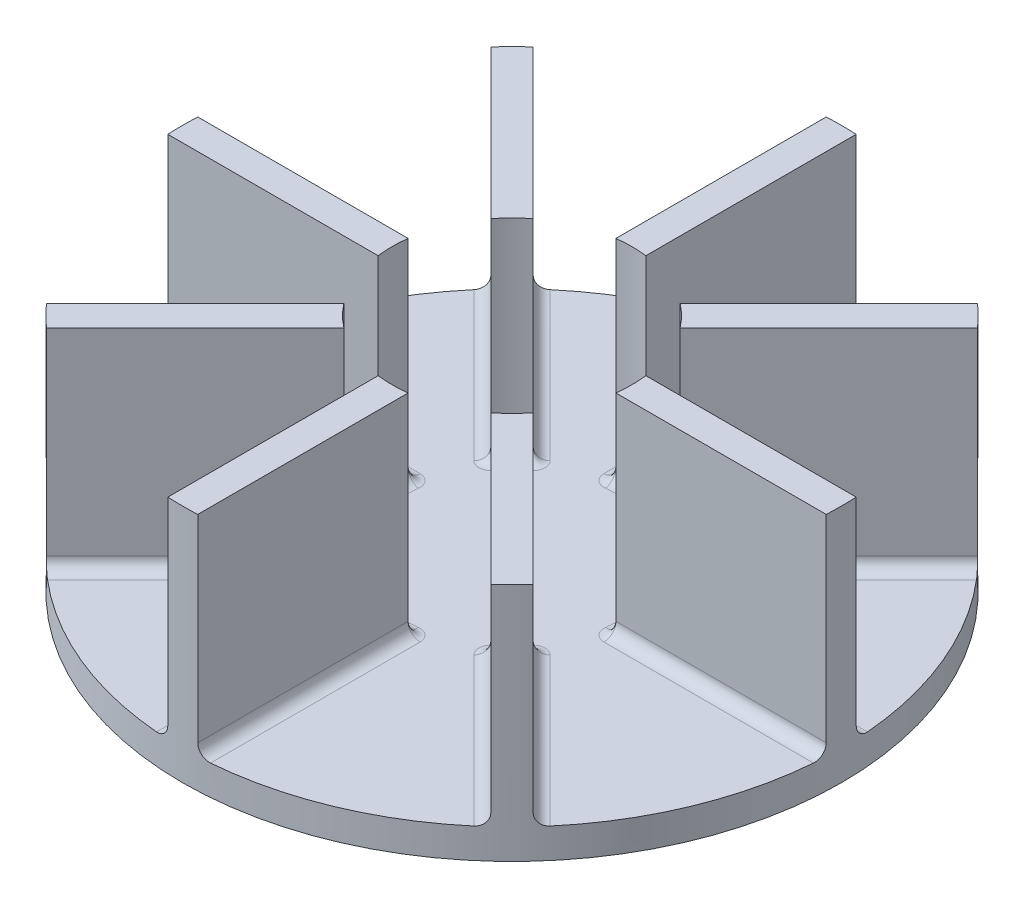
ISO-10303-21;
HEADER;
FILE_DESCRIPTION(('STEP AP214'),'2;1');
FILE_NAME('part.step','',(''),(''),'','','');
FILE_SCHEMA(('AUTOMOTIVE_DESIGN { 1 0 10303 214 1 1 1 1 }'));
ENDSEC;
DATA;
#1=APPLICATION_CONTEXT('core data for automotive mechanical design processes');
#2=APPLICATION_PROTOCOL_DEFINITION('international standard','automotive_design',2000,#1);
#3=PRODUCT_CONTEXT('',#1,'mechanical');
#4=PRODUCT('Part','Part','',(#3));
#5=PRODUCT_RELATED_PRODUCT_CATEGORY('part','',(#4));
#6=PRODUCT_DEFINITION_FORMATION('','',#4);
#7=PRODUCT_DEFINITION_CONTEXT('part definition',#1,'design');
#8=PRODUCT_DEFINITION('design','',#6,#7);
#9=PRODUCT_DEFINITION_SHAPE('','',#8);
#10=(LENGTH_UNIT() NAMED_UNIT(*) SI_UNIT(.MILLI.,.METRE.));
#11=(NAMED_UNIT(*) PLANE_ANGLE_UNIT() SI_UNIT($,.RADIAN.));
#12=(NAMED_UNIT(*) SI_UNIT($,.STERADIAN.) SOLID_ANGLE_UNIT());
#13=UNCERTAINTY_MEASURE_WITH_UNIT(LENGTH_MEASURE(1.E-05),#10,'distance_accuracy_value','');
#14=(GEOMETRIC_REPRESENTATION_CONTEXT(3) GLOBAL_UNCERTAINTY_ASSIGNED_CONTEXT((#13)) GLOBAL_UNIT_ASSIGNED_CONTEXT((#10,
#11,#12)) REPRESENTATION_CONTEXT('',''));
#15=CARTESIAN_POINT('',(0.,0.,0.));
#16=DIRECTION('',(0.,0.,1.));
#17=DIRECTION('',(1.,0.,0.));
#18=AXIS2_PLACEMENT_3D('',#15,#16,#17);
#19=CARTESIAN_POINT('',(0.,0.,0.));
#20=DIRECTION('',(0.,1.,0.));
#21=DIRECTION('',(0.,0.,1.));
#22=AXIS2_PLACEMENT_3D('',#19,#20,#21);
#23=PLANE('',#22);
#24=CARTESIAN_POINT('',(0.,0.,0.));
#25=DIRECTION('',(0.,1.,0.));
#26=DIRECTION('',(0.,0.,1.));
#27=AXIS2_PLACEMENT_3D('',#24,#25,#26);
#28=CIRCLE('',#27,55.);
#29=CARTESIAN_POINT('',(-41.9424629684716,0.,-35.5785019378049));
#30=VERTEX_POINT('',#29);
#31=CARTESIAN_POINT('',(-54.8155999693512,0.,-4.50000000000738));
#32=VERTEX_POINT('',#31);
#33=EDGE_CURVE('E876',#30,#32,#28,.T.);
#34=ORIENTED_EDGE('',*,*,#33,.T.);
#35=DIRECTION('',(-1.,0.,-1.34539846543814E-13));
#36=VECTOR('',#35,1.);
#37=CARTESIAN_POINT('',(6.05429309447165E-13,0.,-4.50000000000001));
#38=LINE('',#37,#36);
#39=CARTESIAN_POINT('',(-19.8431348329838,0.,-4.50000000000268));
#40=VERTEX_POINT('',#39);
#41=EDGE_CURVE('E671',#32,#40,#38,.F.);
#42=ORIENTED_EDGE('',*,*,#41,.T.);
#43=CARTESIAN_POINT('',(-19.8431348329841,0.,-2.50000000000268));
#44=DIRECTION('',(0.,1.,0.));
#45=DIRECTION('',(0.,0.,1.));
#46=AXIS2_PLACEMENT_3D('',#43,#44,#45);
#47=CIRCLE('',#46,2.);
#48=CARTESIAN_POINT('',(-17.8588213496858,0.,-2.25000000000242));
#49=VERTEX_POINT('',#48);
#50=EDGE_CURVE('E668',#49,#40,#47,.T.);
#51=ORIENTED_EDGE('',*,*,#50,.F.);
#52=CARTESIAN_POINT('',(0.,0.,0.));
#53=DIRECTION('',(0.,1.,0.));
#54=DIRECTION('',(0.,0.,1.));
#55=AXIS2_PLACEMENT_3D('',#52,#53,#54);
#56=CIRCLE('',#55,18.0000000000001);
#57=CARTESIAN_POINT('',(-17.8588213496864,0.,2.24999999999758));
#58=VERTEX_POINT('',#57);
#59=EDGE_CURVE('E666',#49,#58,#56,.T.);
#60=ORIENTED_EDGE('',*,*,#59,.T.);
#61=CARTESIAN_POINT('',(-19.8431348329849,0.,2.49999999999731));
#62=DIRECTION('',(0.,1.,0.));
#63=DIRECTION('',(0.,0.,1.));
#64=AXIS2_PLACEMENT_3D('',#61,#62,#63);
#65=CIRCLE('',#64,2.);
#66=CARTESIAN_POINT('',(-19.8431348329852,0.,4.49999999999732));
#67=VERTEX_POINT('',#66);
#68=EDGE_CURVE('E663',#67,#58,#65,.T.);
#69=ORIENTED_EDGE('',*,*,#68,.F.);
#70=DIRECTION('',(1.,0.,1.34947580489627E-13));
#71=VECTOR('',#70,1.);
#72=CARTESIAN_POINT('',(-6.07264112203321E-13,0.,4.5));
#73=LINE('',#72,#71);
#74=CARTESIAN_POINT('',(-54.8155999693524,0.,4.4999999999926));
#75=VERTEX_POINT('',#74);
#76=EDGE_CURVE('E661',#67,#75,#73,.F.);
#77=ORIENTED_EDGE('',*,*,#76,.T.);
#78=CARTESIAN_POINT('',(-41.9424629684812,0.,35.5785019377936));
#79=VERTEX_POINT('',#78);
#80=EDGE_CURVE('E881',#75,#79,#28,.T.);
#81=ORIENTED_EDGE('',*,*,#80,.T.);
#82=DIRECTION('',(-0.707106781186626,0.,0.707106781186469));
#83=VECTOR('',#82,1.);
#84=CARTESIAN_POINT('',(-3.18198051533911,0.,-3.18198051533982));
#85=LINE('',#84,#83);
#86=CARTESIAN_POINT('',(-17.213195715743,0.,10.8492346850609));
#87=VERTEX_POINT('',#86);
#88=EDGE_CURVE('E659',#79,#87,#85,.F.);
#89=ORIENTED_EDGE('',*,*,#88,.T.);
#90=CARTESIAN_POINT('',(-15.79898215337,0.,12.2634482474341));
#91=DIRECTION('',(0.,1.,0.));
#92=DIRECTION('',(0.,0.,1.));
#93=AXIS2_PLACEMENT_3D('',#90,#91,#92);
#94=CIRCLE('',#93,2.);
#95=CARTESIAN_POINT('',(-14.2190839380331,0.,11.0371034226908));
#96=VERTEX_POINT('',#95);
#97=EDGE_CURVE('E656',#96,#87,#94,.T.);
#98=ORIENTED_EDGE('',*,*,#97,.F.);
#99=CARTESIAN_POINT('',(0.,0.,0.));
#100=DIRECTION('',(0.,1.,0.));
#101=DIRECTION('',(0.,0.,1.));
#102=AXIS2_PLACEMENT_3D('',#99,#100,#101);
#103=CIRCLE('',#102,18.0000000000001);
#104=CARTESIAN_POINT('',(-11.037103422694,0.,14.2190839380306));
#105=VERTEX_POINT('',#104);
#106=EDGE_CURVE('E654',#96,#105,#103,.T.);
#107=ORIENTED_EDGE('',*,*,#106,.T.);
#108=CARTESIAN_POINT('',(-12.2634482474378,0.,15.7989821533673));
#109=DIRECTION('',(0.,1.,0.));
#110=DIRECTION('',(0.,0.,1.));
#111=AXIS2_PLACEMENT_3D('',#108,#109,#110);
#112=CIRCLE('',#111,2.);
#113=CARTESIAN_POINT('',(-10.8492346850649,0.,17.2131957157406));
#114=VERTEX_POINT('',#113);
#115=EDGE_CURVE('E651',#114,#105,#112,.T.);
#116=ORIENTED_EDGE('',*,*,#115,.F.);
#117=DIRECTION('',(0.707106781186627,0.,-0.707106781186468));
#118=VECTOR('',#117,1.);
#119=CARTESIAN_POINT('',(3.18198051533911,0.,3.18198051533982));
#120=LINE('',#119,#118);
#121=CARTESIAN_POINT('',(-35.578501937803,0.,41.9424629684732));
#122=VERTEX_POINT('',#121);
#123=EDGE_CURVE('E649',#114,#122,#120,.F.);
#124=ORIENTED_EDGE('',*,*,#123,.T.);
#125=CARTESIAN_POINT('',(-4.5000000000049,0.,54.8155999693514));
#126=VERTEX_POINT('',#125);
#127=EDGE_CURVE('E1717',#122,#126,#28,.T.);
#128=ORIENTED_EDGE('',*,*,#127,.T.);
#129=DIRECTION('',(0.,0.,1.));
#130=VECTOR('',#129,1.);
#131=CARTESIAN_POINT('',(-4.50000000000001,0.,-4.01877403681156E-13));
#132=LINE('',#131,#130);
#133=CARTESIAN_POINT('',(-4.50000000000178,0.,19.843134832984));
#134=VERTEX_POINT('',#133);
#135=EDGE_CURVE('E647',#126,#134,#132,.F.);
#136=ORIENTED_EDGE('',*,*,#135,.T.);
#137=CARTESIAN_POINT('',(-2.50000000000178,0.,19.8431348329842));
#138=DIRECTION('',(0.,1.,0.));
#139=DIRECTION('',(0.,0.,1.));
#140=AXIS2_PLACEMENT_3D('',#137,#138,#139);
#141=CIRCLE('',#140,2.);
#142=CARTESIAN_POINT('',(-2.25000000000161,0.,17.8588213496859));
#143=VERTEX_POINT('',#142);
#144=EDGE_CURVE('E644',#143,#134,#141,.T.);
#145=ORIENTED_EDGE('',*,*,#144,.F.);
#146=CARTESIAN_POINT('',(0.,0.,0.));
#147=DIRECTION('',(0.,1.,0.));
#148=DIRECTION('',(0.,0.,1.));
#149=AXIS2_PLACEMENT_3D('',#146,#147,#148);
#150=CIRCLE('',#149,18.0000000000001);
#151=CARTESIAN_POINT('',(2.24999999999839,0.,17.8588213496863));
#152=VERTEX_POINT('',#151);
#153=EDGE_CURVE('E642',#143,#152,#150,.T.);
#154=ORIENTED_EDGE('',*,*,#153,.T.);
#155=CARTESIAN_POINT('',(2.49999999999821,0.,19.8431348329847));
#156=DIRECTION('',(0.,1.,0.));
#157=DIRECTION('',(0.,0.,1.));
#158=AXIS2_PLACEMENT_3D('',#155,#156,#157);
#159=CIRCLE('',#158,2.);
#160=CARTESIAN_POINT('',(4.49999999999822,0.,19.843134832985));
#161=VERTEX_POINT('',#160);
#162=EDGE_CURVE('E639',#161,#152,#159,.T.);
#163=ORIENTED_EDGE('',*,*,#162,.F.);
#164=DIRECTION('',(0.,0.,-1.));
#165=VECTOR('',#164,1.);
#166=CARTESIAN_POINT('',(4.5,0.,4.03656606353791E-13));
#167=LINE('',#166,#165);
#168=CARTESIAN_POINT('',(4.49999999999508,0.,54.8155999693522));
#169=VERTEX_POINT('',#168);
#170=EDGE_CURVE('E637',#161,#169,#167,.F.);
#171=ORIENTED_EDGE('',*,*,#170,.T.);
#172=CARTESIAN_POINT('',(35.5785019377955,0.,41.9424629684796));
#173=VERTEX_POINT('',#172);
#174=EDGE_CURVE('E1718',#169,#173,#28,.T.);
#175=ORIENTED_EDGE('',*,*,#174,.T.);
#176=DIRECTION('',(0.7071067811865,0.,0.707106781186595));
#177=VECTOR('',#176,1.);
#178=CARTESIAN_POINT('',(-3.18198051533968,0.,3.18198051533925));
#179=LINE('',#178,#177);
#180=CARTESIAN_POINT('',(10.8492346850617,0.,17.2131957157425));
#181=VERTEX_POINT('',#180);
#182=EDGE_CURVE('E635',#173,#181,#179,.F.);
#183=ORIENTED_EDGE('',*,*,#182,.T.);
#184=CARTESIAN_POINT('',(12.2634482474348,0.,15.7989821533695));
#185=DIRECTION('',(0.,1.,0.));
#186=DIRECTION('',(0.,0.,1.));
#187=AXIS2_PLACEMENT_3D('',#184,#185,#186);
#188=CIRCLE('',#187,2.);
#189=CARTESIAN_POINT('',(11.0371034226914,0.,14.2190839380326));
#190=VERTEX_POINT('',#189);
#191=EDGE_CURVE('E632',#190,#181,#188,.T.);
#192=ORIENTED_EDGE('',*,*,#191,.F.);
#193=CARTESIAN_POINT('',(0.,0.,0.));
#194=DIRECTION('',(0.,1.,0.));
#195=DIRECTION('',(0.,0.,1.));
#196=AXIS2_PLACEMENT_3D('',#193,#194,#195);
#197=CIRCLE('',#196,18.0000000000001);
#198=CARTESIAN_POINT('',(14.2190839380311,0.,11.0371034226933));
#199=VERTEX_POINT('',#198);
#200=EDGE_CURVE('E630',#190,#199,#197,.T.);
#201=ORIENTED_EDGE('',*,*,#200,.T.);
#202=CARTESIAN_POINT('',(15.7989821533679,0.,12.263448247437));
#203=DIRECTION('',(0.,1.,0.));
#204=DIRECTION('',(0.,0.,1.));
#205=AXIS2_PLACEMENT_3D('',#202,#203,#204);
#206=CIRCLE('',#205,2.);
#207=CARTESIAN_POINT('',(17.2131957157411,0.,10.8492346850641));
#208=VERTEX_POINT('',#207);
#209=EDGE_CURVE('E627',#208,#199,#206,.T.);
#210=ORIENTED_EDGE('',*,*,#209,.F.);
#211=DIRECTION('',(-0.7071067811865,0.,-0.707106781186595));
#212=VECTOR('',#211,1.);
#213=CARTESIAN_POINT('',(3.18198051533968,0.,-3.18198051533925));
#214=LINE('',#213,#212);
#215=CARTESIAN_POINT('',(41.9424629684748,0.,35.5785019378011));
#216=VERTEX_POINT('',#215);
#217=EDGE_CURVE('E625',#208,#216,#214,.F.);
#218=ORIENTED_EDGE('',*,*,#217,.T.);
#219=CARTESIAN_POINT('',(54.8155999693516,0.,4.50000000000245));
#220=VERTEX_POINT('',#219);
#221=EDGE_CURVE('E1720',#216,#220,#28,.T.);
#222=ORIENTED_EDGE('',*,*,#221,.T.);
#223=DIRECTION('',(1.,0.,0.));
#224=VECTOR('',#223,1.);
#225=CARTESIAN_POINT('',(-3.0468845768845E-13,0.,4.49999999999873));
#226=LINE('',#225,#224);
#227=CARTESIAN_POINT('',(19.8431348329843,0.,4.50000000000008));
#228=VERTEX_POINT('',#227);
#229=EDGE_CURVE('E623',#220,#228,#226,.F.);
#230=ORIENTED_EDGE('',*,*,#229,.T.);
#231=CARTESIAN_POINT('',(19.8431348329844,0.,2.50000000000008));
#232=DIRECTION('',(0.,1.,0.));
#233=DIRECTION('',(0.,0.,1.));
#234=AXIS2_PLACEMENT_3D('',#231,#232,#233);
#235=CIRCLE('',#234,2.);
#236=CARTESIAN_POINT('',(17.858821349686,0.,2.25000000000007));
#237=VERTEX_POINT('',#236);
#238=EDGE_CURVE('E620',#237,#228,#235,.T.);
#239=ORIENTED_EDGE('',*,*,#238,.F.);
#240=CARTESIAN_POINT('',(0.,0.,0.));
#241=DIRECTION('',(0.,1.,0.));
#242=DIRECTION('',(0.,0.,1.));
#243=AXIS2_PLACEMENT_3D('',#240,#241,#242);
#244=CIRCLE('',#243,18.);
#245=CARTESIAN_POINT('',(17.858821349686,0.,-2.24999999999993));
#246=VERTEX_POINT('',#245);
#247=EDGE_CURVE('E618',#237,#246,#244,.T.);
#248=ORIENTED_EDGE('',*,*,#247,.T.);
#249=CARTESIAN_POINT('',(19.8431348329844,0.,-2.49999999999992));
#250=DIRECTION('',(0.,1.,0.));
#251=DIRECTION('',(0.,0.,1.));
#252=AXIS2_PLACEMENT_3D('',#249,#250,#251);
#253=CIRCLE('',#252,2.);
#254=CARTESIAN_POINT('',(19.8431348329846,0.,-4.49999999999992));
#255=VERTEX_POINT('',#254);
#256=EDGE_CURVE('E615',#255,#246,#253,.T.);
#257=ORIENTED_EDGE('',*,*,#256,.F.);
#258=DIRECTION('',(-1.,0.,0.));
#259=VECTOR('',#258,1.);
#260=CARTESIAN_POINT('',(3.06578860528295E-13,0.,-4.50000000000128));
#261=LINE('',#260,#259);
#262=CARTESIAN_POINT('',(54.815599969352,0.,-4.49999999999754));
#263=VERTEX_POINT('',#262);
#264=EDGE_CURVE('E613',#255,#263,#261,.F.);
#265=ORIENTED_EDGE('',*,*,#264,.T.);
#266=CARTESIAN_POINT('',(41.9424629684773,0.,-35.5785019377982));
#267=VERTEX_POINT('',#266);
#268=EDGE_CURVE('E575',#263,#267,#28,.T.);
#269=ORIENTED_EDGE('',*,*,#268,.T.);
#270=DIRECTION('',(0.707106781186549,0.,-0.707106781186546));
#271=VECTOR('',#270,1.);
#272=CARTESIAN_POINT('',(3.18198051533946,0.,3.18198051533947));
#273=LINE('',#272,#271);
#274=CARTESIAN_POINT('',(17.2131957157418,0.,-10.8492346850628));
#275=VERTEX_POINT('',#274);
#276=EDGE_CURVE('E611',#267,#275,#273,.F.);
#277=ORIENTED_EDGE('',*,*,#276,.T.);
#278=CARTESIAN_POINT('',(15.7989821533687,0.,-12.2634482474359));
#279=DIRECTION('',(0.,1.,0.));
#280=DIRECTION('',(0.,0.,1.));
#281=AXIS2_PLACEMENT_3D('',#278,#279,#280);
#282=CIRCLE('',#281,2.);
#283=CARTESIAN_POINT('',(14.2190839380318,0.,-11.0371034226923));
#284=VERTEX_POINT('',#283);
#285=EDGE_CURVE('E608',#284,#275,#282,.T.);
#286=ORIENTED_EDGE('',*,*,#285,.F.);
#287=CARTESIAN_POINT('',(0.,0.,0.));
#288=DIRECTION('',(0.,1.,0.));
#289=DIRECTION('',(0.,0.,1.));
#290=AXIS2_PLACEMENT_3D('',#287,#288,#289);
#291=CIRCLE('',#290,18.);
#292=CARTESIAN_POINT('',(11.0371034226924,0.,-14.2190839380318));
#293=VERTEX_POINT('',#292);
#294=EDGE_CURVE('E606',#284,#293,#291,.T.);
#295=ORIENTED_EDGE('',*,*,#294,.T.);
#296=CARTESIAN_POINT('',(12.2634482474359,0.,-15.7989821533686));
#297=DIRECTION('',(0.,1.,0.));
#298=DIRECTION('',(0.,0.,1.));
#299=AXIS2_PLACEMENT_3D('',#296,#297,#298);
#300=CIRCLE('',#299,2.);
#301=CARTESIAN_POINT('',(10.8492346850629,0.,-17.2131957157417));
#302=VERTEX_POINT('',#301);
#303=EDGE_CURVE('E603',#302,#293,#300,.T.);
#304=ORIENTED_EDGE('',*,*,#303,.F.);
#305=DIRECTION('',(-0.707106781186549,0.,0.707106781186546));
#306=VECTOR('',#305,1.);
#307=CARTESIAN_POINT('',(-3.18198051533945,0.,-3.18198051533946));
#308=LINE('',#307,#306);
#309=CARTESIAN_POINT('',(35.5785019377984,0.,-41.9424629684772));
#310=VERTEX_POINT('',#309);
#311=EDGE_CURVE('E601',#302,#310,#308,.F.);
#312=ORIENTED_EDGE('',*,*,#311,.T.);
#313=CARTESIAN_POINT('',(4.5,0.,-54.8155999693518));
#314=VERTEX_POINT('',#313);
#315=EDGE_CURVE('E568',#310,#314,#28,.T.);
#316=ORIENTED_EDGE('',*,*,#315,.T.);
#317=DIRECTION('',(0.,0.,-1.));
#318=VECTOR('',#317,1.);
#319=CARTESIAN_POINT('',(4.50000000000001,0.,0.));
#320=LINE('',#319,#318);
#321=CARTESIAN_POINT('',(4.5,0.,-19.8431348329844));
#322=VERTEX_POINT('',#321);
#323=EDGE_CURVE('E599',#314,#322,#320,.F.);
#324=ORIENTED_EDGE('',*,*,#323,.T.);
#325=CARTESIAN_POINT('',(2.5,0.,-19.8431348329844));
#326=DIRECTION('',(0.,1.,0.));
#327=DIRECTION('',(0.,0.,1.));
#328=AXIS2_PLACEMENT_3D('',#325,#326,#327);
#329=CIRCLE('',#328,2.);
#330=CARTESIAN_POINT('',(2.25,0.,-17.858821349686));
#331=VERTEX_POINT('',#330);
#332=EDGE_CURVE('E596',#331,#322,#329,.T.);
#333=ORIENTED_EDGE('',*,*,#332,.F.);
#334=CARTESIAN_POINT('',(0.,0.,0.));
#335=DIRECTION('',(0.,1.,0.));
#336=DIRECTION('',(0.,0.,1.));
#337=AXIS2_PLACEMENT_3D('',#334,#335,#336);
#338=CIRCLE('',#337,18.);
#339=CARTESIAN_POINT('',(-2.25,0.,-17.858821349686));
#340=VERTEX_POINT('',#339);
#341=EDGE_CURVE('E594',#331,#340,#338,.T.);
#342=ORIENTED_EDGE('',*,*,#341,.T.);
#343=CARTESIAN_POINT('',(-2.5,0.,-19.8431348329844));
#344=DIRECTION('',(0.,1.,0.));
#345=DIRECTION('',(0.,0.,1.));
#346=AXIS2_PLACEMENT_3D('',#343,#344,#345);
#347=CIRCLE('',#346,2.);
#348=CARTESIAN_POINT('',(-4.5,0.,-19.8431348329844));
#349=VERTEX_POINT('',#348);
#350=EDGE_CURVE('E591',#349,#340,#347,.T.);
#351=ORIENTED_EDGE('',*,*,#350,.F.);
#352=DIRECTION('',(0.,0.,1.));
#353=VECTOR('',#352,1.);
#354=CARTESIAN_POINT('',(-4.49999999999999,0.,0.));
#355=LINE('',#354,#353);
#356=CARTESIAN_POINT('',(-4.5,0.,-54.8155999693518));
#357=VERTEX_POINT('',#356);
#358=EDGE_CURVE('E589',#349,#357,#355,.F.);
#359=ORIENTED_EDGE('',*,*,#358,.T.);
#360=CARTESIAN_POINT('',(-35.5785019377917,0.,-41.9424629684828));
#361=VERTEX_POINT('',#360);
#362=EDGE_CURVE('E572',#357,#361,#28,.T.);
#363=ORIENTED_EDGE('',*,*,#362,.T.);
#364=DIRECTION('',(-0.707106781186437,0.,-0.707106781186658));
#365=VECTOR('',#364,1.);
#366=CARTESIAN_POINT('',(3.18198051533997,0.,-3.18198051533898));
#367=LINE('',#366,#365);
#368=CARTESIAN_POINT('',(-10.8492346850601,0.,-17.2131957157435));
#369=VERTEX_POINT('',#368);
#370=EDGE_CURVE('E580',#361,#369,#367,.F.);
#371=ORIENTED_EDGE('',*,*,#370,.T.);
#372=CARTESIAN_POINT('',(-12.2634482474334,0.,-15.7989821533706));
#373=DIRECTION('',(0.,1.,0.));
#374=DIRECTION('',(0.,0.,1.));
#375=AXIS2_PLACEMENT_3D('',#372,#373,#374);
#376=CIRCLE('',#375,2.);
#377=CARTESIAN_POINT('',(-11.0371034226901,0.,-14.2190839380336));
#378=VERTEX_POINT('',#377);
#379=EDGE_CURVE('E577',#378,#369,#376,.T.);
#380=ORIENTED_EDGE('',*,*,#379,.F.);
#381=CARTESIAN_POINT('',(0.,0.,0.));
#382=DIRECTION('',(0.,1.,0.));
#383=DIRECTION('',(0.,0.,1.));
#384=AXIS2_PLACEMENT_3D('',#381,#382,#383);
#385=CIRCLE('',#384,18.0000000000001);
#386=CARTESIAN_POINT('',(-14.2190839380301,0.,-11.0371034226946));
#387=VERTEX_POINT('',#386);
#388=EDGE_CURVE('E582',#378,#387,#385,.T.);
#389=ORIENTED_EDGE('',*,*,#388,.T.);
#390=CARTESIAN_POINT('',(-15.7989821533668,0.,-12.2634482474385));
#391=DIRECTION('',(0.,1.,0.));
#392=DIRECTION('',(0.,0.,1.));
#393=AXIS2_PLACEMENT_3D('',#390,#391,#392);
#394=CIRCLE('',#393,2.);
#395=CARTESIAN_POINT('',(-17.2131957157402,0.,-10.8492346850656));
#396=VERTEX_POINT('',#395);
#397=EDGE_CURVE('E584',#396,#387,#394,.T.);
#398=ORIENTED_EDGE('',*,*,#397,.F.);
#399=DIRECTION('',(0.707106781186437,0.,0.707106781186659));
#400=VECTOR('',#399,1.);
#401=CARTESIAN_POINT('',(-3.18198051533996,0.,3.18198051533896));
#402=LINE('',#401,#400);
#403=EDGE_CURVE('E587',#396,#30,#402,.F.);
#404=ORIENTED_EDGE('',*,*,#403,.T.);
#405=EDGE_LOOP('',(#34,#42,#51,#60,#69,#77,#81,#89,#98,#107,#116,#124,#128,#136,#145,#154,#163,
#171,#175,#183,#192,#201,#210,#218,#222,#230,#239,#248,#257,#265,#269,#277,#286,#295,#304,#312,
#316,#324,#333,#342,#351,#359,#363,#371,#380,#389,#398,#404));
#406=FACE_BOUND('',#405,.T.);
#407=ADVANCED_FACE('F38',(#406),#23,.T.);
#408=CARTESIAN_POINT('',(0.,-5.,0.));
#409=DIRECTION('',(0.,1.,0.));
#410=DIRECTION('',(0.,0.,1.));
#411=AXIS2_PLACEMENT_3D('',#408,#409,#410);
#412=CYLINDRICAL_SURFACE('',#411,55.);
#413=CARTESIAN_POINT('',(0.,-5.,0.));
#414=DIRECTION('',(0.,1.,0.));
#415=DIRECTION('',(0.,0.,1.));
#416=AXIS2_PLACEMENT_3D('',#413,#414,#415);
#417=CIRCLE('',#416,55.);
#418=CARTESIAN_POINT('',(0.,-5.,55.));
#419=VERTEX_POINT('',#418);
#420=EDGE_CURVE('E569',#419,#419,#417,.T.);
#421=ORIENTED_EDGE('',*,*,#420,.T.);
#422=EDGE_LOOP('',(#421));
#423=FACE_BOUND('',#422,.T.);
#424=ORIENTED_EDGE('',*,*,#362,.F.);
#425=CARTESIAN_POINT('',(-4.5,0.,-54.8155999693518));
#426=CARTESIAN_POINT('',(-4.44372149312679,4.54624293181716E-07,-54.8202205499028));
#427=CARTESIAN_POINT('',(-4.387462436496,0.00237695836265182,-54.8247511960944));
#428=CARTESIAN_POINT('',(-4.27533045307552,0.0118619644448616,-54.8336092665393));
#429=CARTESIAN_POINT('',(-4.21945751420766,0.0189703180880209,-54.8379366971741));
#430=CARTESIAN_POINT('',(-4.0531046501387,0.0473340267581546,-54.8505665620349));
#431=CARTESIAN_POINT('',(-3.94371489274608,0.0756281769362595,-54.8585309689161));
#432=CARTESIAN_POINT('',(-3.73117889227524,0.150237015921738,-54.8733969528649));
#433=CARTESIAN_POINT('',(-3.62803618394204,0.196561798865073,-54.8802979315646));
#434=CARTESIAN_POINT('',(-3.43096874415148,0.305933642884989,-54.8929704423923));
#435=CARTESIAN_POINT('',(-3.33704199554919,0.368977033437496,-54.89874222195));
#436=CARTESIAN_POINT('',(-3.1612943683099,0.509856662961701,-54.909142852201));
#437=CARTESIAN_POINT('',(-3.07944800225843,0.587660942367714,-54.9137741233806));
#438=CARTESIAN_POINT('',(-2.92995156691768,0.755967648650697,-54.9219537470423));
#439=CARTESIAN_POINT('',(-2.86230431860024,0.846472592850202,-54.9255018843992));
#440=CARTESIAN_POINT('',(-2.74326920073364,1.03742984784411,-54.9315759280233));
#441=CARTESIAN_POINT('',(-2.69185604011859,1.13786636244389,-54.9341034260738));
#442=CARTESIAN_POINT('',(-2.60663686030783,1.34593931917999,-54.9382132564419));
#443=CARTESIAN_POINT('',(-2.57282027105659,1.45357139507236,-54.9397961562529));
#444=CARTESIAN_POINT('',(-2.53223349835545,1.63489428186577,-54.9416786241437));
#445=CARTESIAN_POINT('',(-2.52015317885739,1.70743829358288,-54.9422327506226));
#446=CARTESIAN_POINT('',(-2.50403758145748,1.85331134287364,-54.9429687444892));
#447=CARTESIAN_POINT('',(-2.49999085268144,1.92663911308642,-54.9431511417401));
#448=CARTESIAN_POINT('',(-2.5,2.,-54.9431524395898));
#449=B_SPLINE_CURVE_WITH_KNOTS('',3,(#425,#426,#427,#428,#429,#430,#431,#432,#433,#434,#435,
#436,#437,#438,#439,#440,#441,#442,#443,#444,#445,#446,#447,#448),.UNSPECIFIED.,.F.,.F.,(4,2,2,
2,2,2,2,2,2,2,2,4),(0.,0.169300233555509,0.338595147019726,0.676662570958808,1.01491952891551,
1.35310228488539,1.69056101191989,2.02808671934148,2.36508397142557,2.70187855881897,
2.92209907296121,3.14200546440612),.UNSPECIFIED.);
#450=CARTESIAN_POINT('',(-2.5,2.,-54.9431524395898));
#451=VERTEX_POINT('',#450);
#452=EDGE_CURVE('E48',#357,#451,#449,.T.);
#453=ORIENTED_EDGE('',*,*,#452,.T.);
#454=DIRECTION('',(0.,-1.,0.));
#455=VECTOR('',#454,1.);
#456=CARTESIAN_POINT('',(-2.5,35.,-54.9431524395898));
#457=LINE('',#456,#455);
#458=CARTESIAN_POINT('',(-2.5,35.,-54.9431524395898));
#459=VERTEX_POINT('',#458);
#460=EDGE_CURVE('E560',#459,#451,#457,.T.);
#461=ORIENTED_EDGE('',*,*,#460,.F.);
#462=CARTESIAN_POINT('',(0.,35.,0.));
#463=DIRECTION('',(0.,1.,0.));
#464=DIRECTION('',(0.,0.,1.));
#465=AXIS2_PLACEMENT_3D('',#462,#463,#464);
#466=CIRCLE('',#465,55.);
#467=CARTESIAN_POINT('',(2.50000000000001,35.,-54.9431524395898));
#468=VERTEX_POINT('',#467);
#469=EDGE_CURVE('E553',#468,#459,#466,.T.);
#470=ORIENTED_EDGE('',*,*,#469,.F.);
#471=DIRECTION('',(0.,-1.,0.));
#472=VECTOR('',#471,1.);
#473=CARTESIAN_POINT('',(2.50000000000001,35.,-54.9431524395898));
#474=LINE('',#473,#472);
#475=CARTESIAN_POINT('',(2.50000000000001,2.,-54.9431524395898));
#476=VERTEX_POINT('',#475);
#477=EDGE_CURVE('E562',#468,#476,#474,.T.);
#478=ORIENTED_EDGE('',*,*,#477,.T.);
#479=CARTESIAN_POINT('',(2.5,2.,-54.9431524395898));
#480=CARTESIAN_POINT('',(2.50000034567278,1.94378357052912,-54.9431519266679));
#481=CARTESIAN_POINT('',(2.5023717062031,1.88759407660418,-54.9430445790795));
#482=CARTESIAN_POINT('',(2.5118318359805,1.77561727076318,-54.942613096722));
#483=CARTESIAN_POINT('',(2.51892037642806,1.71982993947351,-54.9422889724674));
#484=CARTESIAN_POINT('',(2.54719381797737,1.55376964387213,-54.9409881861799));
#485=CARTESIAN_POINT('',(2.57538672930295,1.44460918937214,-54.9396831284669));
#486=CARTESIAN_POINT('',(2.64967357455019,1.23257929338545,-54.9361501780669));
#487=CARTESIAN_POINT('',(2.6957760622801,1.12971288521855,-54.9339218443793));
#488=CARTESIAN_POINT('',(2.8045590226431,0.933189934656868,-54.9284753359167));
#489=CARTESIAN_POINT('',(2.86723661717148,0.839531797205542,-54.9252573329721));
#490=CARTESIAN_POINT('',(3.00739064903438,0.6640617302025,-54.9177613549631));
#491=CARTESIAN_POINT('',(3.08486967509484,0.582251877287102,-54.9134831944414));
#492=CARTESIAN_POINT('',(3.252422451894,0.432788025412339,-54.9038138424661));
#493=CARTESIAN_POINT('',(3.34249855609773,0.365136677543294,-54.8984224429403));
#494=CARTESIAN_POINT('',(3.53275032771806,0.245846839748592,-54.8865080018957));
#495=CARTESIAN_POINT('',(3.63293673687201,0.194225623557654,-54.8799837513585));
#496=CARTESIAN_POINT('',(3.84046132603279,0.108547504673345,-54.8658513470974));
#497=CARTESIAN_POINT('',(3.94779565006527,0.0744812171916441,-54.8582437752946));
#498=CARTESIAN_POINT('',(4.1298012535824,0.0331449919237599,-54.8447815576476));
#499=CARTESIAN_POINT('',(4.20336383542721,0.0207208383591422,-54.8391938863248));
#500=CARTESIAN_POINT('',(4.35127877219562,0.00414937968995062,-54.8276565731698));
#501=CARTESIAN_POINT('',(4.42562982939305,-9.88338495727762E-06,-54.8217074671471));
#502=CARTESIAN_POINT('',(4.5,0.,-54.8155999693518));
#503=B_SPLINE_CURVE_WITH_KNOTS('',3,(#479,#480,#481,#482,#483,#484,#485,#486,#487,#488,#489,
#490,#491,#492,#493,#494,#495,#496,#497,#498,#499,#500,#501,#502),.UNSPECIFIED.,.F.,.F.,(4,2,2,
2,2,2,2,2,2,2,2,4),(0.,0.168545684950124,0.337083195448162,0.673597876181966,1.01027347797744,
1.34689065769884,1.68356676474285,2.02030585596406,2.35740656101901,2.6943268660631,
2.91833405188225,3.14201689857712),.UNSPECIFIED.);
#504=EDGE_CURVE('E833',#476,#314,#503,.T.);
#505=ORIENTED_EDGE('',*,*,#504,.T.);
#506=ORIENTED_EDGE('',*,*,#315,.F.);
#507=CARTESIAN_POINT('',(35.5785019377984,0.,-41.9424629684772));
#508=CARTESIAN_POINT('',(35.6215640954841,4.54624292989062E-07,-41.9059352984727));
#509=CARTESIAN_POINT('',(35.6645489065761,0.00237695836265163,-41.8693577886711));
#510=CARTESIAN_POINT('',(35.7501017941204,0.0118619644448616,-41.7963321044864));
#511=CARTESIAN_POINT('',(35.7926698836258,0.0189703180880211,-41.7598839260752));
#512=CARTESIAN_POINT('',(35.9192297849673,0.0473340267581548,-41.6511853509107));
#513=CARTESIAN_POINT('',(36.0022117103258,0.075628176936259,-41.5794667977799));
#514=CARTESIAN_POINT('',(36.1630091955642,0.150237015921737,-41.4396929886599));
#515=CARTESIAN_POINT('',(36.2408218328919,0.196561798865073,-41.3716398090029));
#516=CARTESIAN_POINT('',(36.3891303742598,0.30593364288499,-41.2412529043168));
#517=CARTESIAN_POINT('',(36.459627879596,0.368977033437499,-41.1789179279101));
#518=CARTESIAN_POINT('',(36.5912545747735,0.509856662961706,-41.0619999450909));
#519=CARTESIAN_POINT('',(36.6524034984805,0.587660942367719,-41.007400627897));
#520=CARTESIAN_POINT('',(36.7638973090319,0.755967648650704,-40.9074745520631));
#521=CARTESIAN_POINT('',(36.8142400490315,0.846472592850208,-40.8621496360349));
#522=CARTESIAN_POINT('',(36.9027055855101,1.03742984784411,-40.7822740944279));
#523=CARTESIAN_POINT('',(36.9408473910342,1.13786636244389,-40.7477067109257));
#524=CARTESIAN_POINT('',(37.0040125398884,1.34593931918,-40.6903537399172));
#525=CARTESIAN_POINT('',(37.0290437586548,1.45357139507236,-40.6675610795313));
#526=CARTESIAN_POINT('',(37.0590740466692,1.63489428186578,-40.6401930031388));
#527=CARTESIAN_POINT('',(37.068007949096,1.70743829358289,-40.6320427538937));
#528=CARTESIAN_POINT('',(37.0799238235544,1.85331134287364,-40.6211677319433));
#529=CARTESIAN_POINT('',(37.0829142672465,1.92663911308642,-40.6184352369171));
#530=CARTESIAN_POINT('',(37.0829087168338,2.,-40.6184426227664));
#531=B_SPLINE_CURVE_WITH_KNOTS('',3,(#507,#508,#509,#510,#511,#512,#513,#514,#515,#516,#517,
#518,#519,#520,#521,#522,#523,#524,#525,#526,#527,#528,#529,#530),.UNSPECIFIED.,.F.,.F.,(4,2,2,
2,2,2,2,2,2,2,2,4),(0.,0.169300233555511,0.338595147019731,0.676662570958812,1.01491952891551,
1.35310228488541,1.6905610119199,2.02808671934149,2.36508397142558,2.70187855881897,
2.92209907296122,3.14200546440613),.UNSPECIFIED.);
#532=CARTESIAN_POINT('',(37.0829087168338,2.,-40.6184426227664));
#533=VERTEX_POINT('',#532);
#534=EDGE_CURVE('E827',#310,#533,#531,.T.);
#535=ORIENTED_EDGE('',*,*,#534,.T.);
#536=DIRECTION('',(0.,-1.,0.));
#537=VECTOR('',#536,1.);
#538=CARTESIAN_POINT('',(37.0829087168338,35.,-40.6184426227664));
#539=LINE('',#538,#537);
#540=CARTESIAN_POINT('',(37.0829087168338,35.,-40.6184426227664));
#541=VERTEX_POINT('',#540);
#542=EDGE_CURVE('E539',#541,#533,#539,.T.);
#543=ORIENTED_EDGE('',*,*,#542,.F.);
#544=CARTESIAN_POINT('',(0.,35.,0.));
#545=DIRECTION('',(0.,1.,0.));
#546=DIRECTION('',(0.,0.,1.));
#547=AXIS2_PLACEMENT_3D('',#544,#545,#546);
#548=CIRCLE('',#547,55.);
#549=CARTESIAN_POINT('',(40.6184426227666,35.,-37.0829087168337));
#550=VERTEX_POINT('',#549);
#551=EDGE_CURVE('E532',#550,#541,#548,.T.);
#552=ORIENTED_EDGE('',*,*,#551,.F.);
#553=DIRECTION('',(0.,-1.,0.));
#554=VECTOR('',#553,1.);
#555=CARTESIAN_POINT('',(40.6184426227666,35.,-37.0829087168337));
#556=LINE('',#555,#554);
#557=CARTESIAN_POINT('',(40.6184426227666,2.,-37.0829087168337));
#558=VERTEX_POINT('',#557);
#559=EDGE_CURVE('E542',#550,#558,#556,.T.);
#560=ORIENTED_EDGE('',*,*,#559,.T.);
#561=CARTESIAN_POINT('',(40.6184426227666,2.,-37.0829087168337));
#562=CARTESIAN_POINT('',(40.6184425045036,1.94378357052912,-37.0829081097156));
#563=CARTESIAN_POINT('',(40.6200434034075,1.88759407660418,-37.0811553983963));
#564=CARTESIAN_POINT('',(40.6264276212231,1.77561727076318,-37.0741609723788));
#565=CARTESIAN_POINT('',(40.6312107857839,1.71982993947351,-37.0689194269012));
#566=CARTESIAN_POINT('',(40.6502833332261,1.55376964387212,-37.0480072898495));
#567=CARTESIAN_POINT('',(40.6692959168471,1.44460918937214,-37.027149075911));
#568=CARTESIAN_POINT('',(40.7193264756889,1.23257929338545,-36.9721221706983));
#569=CARTESIAN_POINT('',(40.7503501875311,1.12971288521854,-36.9379471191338));
#570=CARTESIAN_POINT('',(40.8234200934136,0.933189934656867,-36.8571746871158));
#571=CARTESIAN_POINT('',(40.8654643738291,0.83953179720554,-36.8105794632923));
#572=CARTESIAN_POINT('',(40.9592677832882,0.664061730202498,-36.7061751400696));
#573=CARTESIAN_POINT('',(41.0110286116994,0.5822518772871,-36.6483640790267));
#574=CARTESIAN_POINT('',(41.1226690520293,0.432788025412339,-36.5230491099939));
#575=CARTESIAN_POINT('',(41.1825501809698,0.365136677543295,-36.4555433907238));
#576=CARTESIAN_POINT('',(41.3086537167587,0.245846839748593,-36.3125902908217));
#577=CARTESIAN_POINT('',(41.3748828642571,0.194225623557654,-36.2371344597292));
#578=CARTESIAN_POINT('',(41.5116317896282,0.108547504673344,-36.0803992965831));
#579=CARTESIAN_POINT('',(41.5821492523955,0.0744812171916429,-35.9991231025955));
#580=CARTESIAN_POINT('',(41.7013274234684,0.0331449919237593,-35.8609064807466));
#581=CARTESIAN_POINT('',(41.7493929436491,0.0207208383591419,-35.8049387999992));
#582=CARTESIAN_POINT('',(41.8458264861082,0.00414937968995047,-35.6921890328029));
#583=CARTESIAN_POINT('',(41.8941939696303,-9.88338495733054E-06,-35.6354082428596));
#584=CARTESIAN_POINT('',(41.9424629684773,0.,-35.5785019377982));
#585=B_SPLINE_CURVE_WITH_KNOTS('',3,(#561,#562,#563,#564,#565,#566,#567,#568,#569,#570,#571,
#572,#573,#574,#575,#576,#577,#578,#579,#580,#581,#582,#583,#584),.UNSPECIFIED.,.F.,.F.,(4,2,2,
2,2,2,2,2,2,2,2,4),(0.,0.168545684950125,0.337083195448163,0.673597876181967,1.01027347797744,
1.34689065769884,1.68356676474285,2.02030585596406,2.35740656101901,2.69432686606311,
2.91833405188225,3.14201689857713),.UNSPECIFIED.);
#586=EDGE_CURVE('E820',#558,#267,#585,.T.);
#587=ORIENTED_EDGE('',*,*,#586,.T.);
#588=ORIENTED_EDGE('',*,*,#268,.F.);
#589=CARTESIAN_POINT('',(54.815599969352,0.,-4.49999999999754));
#590=CARTESIAN_POINT('',(54.8202205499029,4.54624292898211E-07,-4.44372149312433));
#591=CARTESIAN_POINT('',(54.8247511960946,0.00237695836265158,-4.38746243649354));
#592=CARTESIAN_POINT('',(54.8336092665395,0.0118619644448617,-4.27533045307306));
#593=CARTESIAN_POINT('',(54.8379366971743,0.018970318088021,-4.21945751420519));
#594=CARTESIAN_POINT('',(54.8505665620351,0.0473340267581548,-4.05310465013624));
#595=CARTESIAN_POINT('',(54.8585309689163,0.0756281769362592,-3.94371489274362));
#596=CARTESIAN_POINT('',(54.8733969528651,0.150237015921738,-3.73117889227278));
#597=CARTESIAN_POINT('',(54.8802979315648,0.196561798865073,-3.62803618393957));
#598=CARTESIAN_POINT('',(54.8929704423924,0.30593364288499,-3.43096874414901));
#599=CARTESIAN_POINT('',(54.8987422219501,0.368977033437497,-3.33704199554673));
#600=CARTESIAN_POINT('',(54.9091428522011,0.509856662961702,-3.16129436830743));
#601=CARTESIAN_POINT('',(54.9137741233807,0.587660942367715,-3.07944800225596));
#602=CARTESIAN_POINT('',(54.9219537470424,0.755967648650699,-2.92995156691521));
#603=CARTESIAN_POINT('',(54.9255018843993,0.846472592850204,-2.86230431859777));
#604=CARTESIAN_POINT('',(54.9315759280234,1.03742984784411,-2.74326920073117));
#605=CARTESIAN_POINT('',(54.9341034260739,1.13786636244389,-2.69185604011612));
#606=CARTESIAN_POINT('',(54.938213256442,1.34593931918,-2.60663686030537));
#607=CARTESIAN_POINT('',(54.939796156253,1.45357139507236,-2.57282027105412));
#608=CARTESIAN_POINT('',(54.9416786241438,1.63489428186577,-2.53223349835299));
#609=CARTESIAN_POINT('',(54.9422327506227,1.70743829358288,-2.52015317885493));
#610=CARTESIAN_POINT('',(54.9429687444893,1.85331134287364,-2.50403758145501));
#611=CARTESIAN_POINT('',(54.9431511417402,1.92663911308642,-2.49999085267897));
#612=CARTESIAN_POINT('',(54.9431524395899,2.,-2.49999999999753));
#613=B_SPLINE_CURVE_WITH_KNOTS('',3,(#589,#590,#591,#592,#593,#594,#595,#596,#597,#598,#599,
#600,#601,#602,#603,#604,#605,#606,#607,#608,#609,#610,#611,#612),.UNSPECIFIED.,.F.,.F.,(4,2,2,
2,2,2,2,2,2,2,2,4),(0.,0.16930023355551,0.338595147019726,0.67666257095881,1.01491952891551,
1.3531022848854,1.69056101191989,2.02808671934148,2.36508397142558,2.70187855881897,
2.92209907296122,3.14200546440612),.UNSPECIFIED.);
#614=CARTESIAN_POINT('',(54.9431524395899,2.,-2.49999999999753));
#615=VERTEX_POINT('',#614);
#616=EDGE_CURVE('E813',#263,#615,#613,.T.);
#617=ORIENTED_EDGE('',*,*,#616,.T.);
#618=DIRECTION('',(0.,-1.,0.));
#619=VECTOR('',#618,1.);
#620=CARTESIAN_POINT('',(54.9431524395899,35.,-2.49999999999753));
#621=LINE('',#620,#619);
#622=CARTESIAN_POINT('',(54.9431524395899,35.,-2.49999999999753));
#623=VERTEX_POINT('',#622);
#624=EDGE_CURVE('E518',#623,#615,#621,.T.);
#625=ORIENTED_EDGE('',*,*,#624,.F.);
#626=CARTESIAN_POINT('',(0.,35.,0.));
#627=DIRECTION('',(0.,1.,0.));
#628=DIRECTION('',(0.,0.,1.));
#629=AXIS2_PLACEMENT_3D('',#626,#627,#628);
#630=CIRCLE('',#629,55.);
#631=CARTESIAN_POINT('',(54.9431524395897,35.,2.50000000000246));
#632=VERTEX_POINT('',#631);
#633=EDGE_CURVE('E511',#632,#623,#630,.T.);
#634=ORIENTED_EDGE('',*,*,#633,.F.);
#635=DIRECTION('',(0.,-1.,0.));
#636=VECTOR('',#635,1.);
#637=CARTESIAN_POINT('',(54.9431524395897,35.,2.50000000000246));
#638=LINE('',#637,#636);
#639=CARTESIAN_POINT('',(54.9431524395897,2.,2.50000000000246));
#640=VERTEX_POINT('',#639);
#641=EDGE_CURVE('E521',#632,#640,#638,.T.);
#642=ORIENTED_EDGE('',*,*,#641,.T.);
#643=CARTESIAN_POINT('',(54.9431524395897,2.,2.50000000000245));
#644=CARTESIAN_POINT('',(54.9431519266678,1.94378357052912,2.50000034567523));
#645=CARTESIAN_POINT('',(54.9430445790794,1.88759407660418,2.50237170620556));
#646=CARTESIAN_POINT('',(54.9426130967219,1.77561727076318,2.51183183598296));
#647=CARTESIAN_POINT('',(54.9422889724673,1.71982993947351,2.51892037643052));
#648=CARTESIAN_POINT('',(54.9409881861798,1.55376964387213,2.54719381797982));
#649=CARTESIAN_POINT('',(54.9396831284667,1.44460918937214,2.57538672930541));
#650=CARTESIAN_POINT('',(54.9361501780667,1.23257929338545,2.64967357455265));
#651=CARTESIAN_POINT('',(54.9339218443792,1.12971288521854,2.69577606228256));
#652=CARTESIAN_POINT('',(54.9284753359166,0.933189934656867,2.80455902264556));
#653=CARTESIAN_POINT('',(54.9252573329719,0.83953179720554,2.86723661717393));
#654=CARTESIAN_POINT('',(54.917761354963,0.664061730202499,3.00739064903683));
#655=CARTESIAN_POINT('',(54.9134831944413,0.582251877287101,3.0848696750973));
#656=CARTESIAN_POINT('',(54.903813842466,0.432788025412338,3.25242245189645));
#657=CARTESIAN_POINT('',(54.8984224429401,0.365136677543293,3.34249855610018));
#658=CARTESIAN_POINT('',(54.8865080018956,0.245846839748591,3.53275032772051));
#659=CARTESIAN_POINT('',(54.8799837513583,0.194225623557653,3.63293673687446));
#660=CARTESIAN_POINT('',(54.8658513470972,0.108547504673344,3.84046132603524));
#661=CARTESIAN_POINT('',(54.8582437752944,0.0744812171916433,3.94779565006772));
#662=CARTESIAN_POINT('',(54.8447815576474,0.0331449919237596,4.12980125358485));
#663=CARTESIAN_POINT('',(54.8391938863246,0.020720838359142,4.20336383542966));
#664=CARTESIAN_POINT('',(54.8276565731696,0.00414937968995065,4.35127877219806));
#665=CARTESIAN_POINT('',(54.8217074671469,-9.88338495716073E-06,4.4256298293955));
#666=CARTESIAN_POINT('',(54.8155999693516,0.,4.50000000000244));
#667=B_SPLINE_CURVE_WITH_KNOTS('',3,(#643,#644,#645,#646,#647,#648,#649,#650,#651,#652,#653,
#654,#655,#656,#657,#658,#659,#660,#661,#662,#663,#664,#665,#666),.UNSPECIFIED.,.F.,.F.,(4,2,2,
2,2,2,2,2,2,2,2,4),(0.,0.168545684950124,0.337083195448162,0.673597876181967,1.01027347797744,
1.34689065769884,1.68356676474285,2.02030585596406,2.35740656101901,2.69432686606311,
2.91833405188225,3.14201689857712),.UNSPECIFIED.);
#668=EDGE_CURVE('E806',#640,#220,#667,.T.);
#669=ORIENTED_EDGE('',*,*,#668,.T.);
#670=ORIENTED_EDGE('',*,*,#221,.F.);
#671=CARTESIAN_POINT('',(41.9424629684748,0.,35.5785019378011));
#672=CARTESIAN_POINT('',(41.9059352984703,4.54624292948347E-07,35.6215640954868));
#673=CARTESIAN_POINT('',(41.8693577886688,0.00237695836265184,35.6645489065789));
#674=CARTESIAN_POINT('',(41.7963321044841,0.0118619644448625,35.7501017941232));
#675=CARTESIAN_POINT('',(41.7598839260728,0.0189703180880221,35.7926698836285));
#676=CARTESIAN_POINT('',(41.6511853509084,0.0473340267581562,35.91922978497));
#677=CARTESIAN_POINT('',(41.5794667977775,0.0756281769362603,36.0022117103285));
#678=CARTESIAN_POINT('',(41.4396929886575,0.150237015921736,36.1630091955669));
#679=CARTESIAN_POINT('',(41.3716398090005,0.19656179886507,36.2408218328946));
#680=CARTESIAN_POINT('',(41.2412529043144,0.305933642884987,36.3891303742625));
#681=CARTESIAN_POINT('',(41.1789179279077,0.368977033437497,36.4596278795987));
#682=CARTESIAN_POINT('',(41.0619999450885,0.509856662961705,36.5912545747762));
#683=CARTESIAN_POINT('',(41.0074006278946,0.587660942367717,36.6524034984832));
#684=CARTESIAN_POINT('',(40.9074745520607,0.755967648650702,36.7638973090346));
#685=CARTESIAN_POINT('',(40.8621496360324,0.846472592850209,36.8142400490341));
#686=CARTESIAN_POINT('',(40.7822740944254,1.03742984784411,36.9027055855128));
#687=CARTESIAN_POINT('',(40.7477067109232,1.13786636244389,36.9408473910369));
#688=CARTESIAN_POINT('',(40.6903537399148,1.34593931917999,37.004012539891));
#689=CARTESIAN_POINT('',(40.6675610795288,1.45357139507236,37.0290437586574));
#690=CARTESIAN_POINT('',(40.6401930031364,1.63489428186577,37.0590740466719));
#691=CARTESIAN_POINT('',(40.6320427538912,1.70743829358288,37.0680079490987));
#692=CARTESIAN_POINT('',(40.6211677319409,1.85331134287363,37.079923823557));
#693=CARTESIAN_POINT('',(40.6184352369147,1.92663911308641,37.0829142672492));
#694=CARTESIAN_POINT('',(40.618442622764,2.,37.0829087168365));
#695=B_SPLINE_CURVE_WITH_KNOTS('',3,(#671,#672,#673,#674,#675,#676,#677,#678,#679,#680,#681,
#682,#683,#684,#685,#686,#687,#688,#689,#690,#691,#692,#693,#694),.UNSPECIFIED.,.F.,.F.,(4,2,2,
2,2,2,2,2,2,2,2,4),(0.,0.169300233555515,0.338595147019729,0.676662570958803,1.0149195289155,
1.35310228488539,1.69056101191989,2.02808671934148,2.36508397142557,2.70187855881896,
2.92209907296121,3.14200546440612),.UNSPECIFIED.);
#696=CARTESIAN_POINT('',(40.618442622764,2.,37.0829087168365));
#697=VERTEX_POINT('',#696);
#698=EDGE_CURVE('E799',#216,#697,#695,.T.);
#699=ORIENTED_EDGE('',*,*,#698,.T.);
#700=DIRECTION('',(0.,-1.,0.));
#701=VECTOR('',#700,1.);
#702=CARTESIAN_POINT('',(40.618442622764,35.,37.0829087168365));
#703=LINE('',#702,#701);
#704=CARTESIAN_POINT('',(40.618442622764,35.,37.0829087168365));
#705=VERTEX_POINT('',#704);
#706=EDGE_CURVE('E497',#705,#697,#703,.T.);
#707=ORIENTED_EDGE('',*,*,#706,.F.);
#708=CARTESIAN_POINT('',(0.,35.,0.));
#709=DIRECTION('',(0.,1.,0.));
#710=DIRECTION('',(0.,0.,1.));
#711=AXIS2_PLACEMENT_3D('',#708,#709,#710);
#712=CIRCLE('',#711,55.);
#713=CARTESIAN_POINT('',(37.082908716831,35.,40.618442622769));
#714=VERTEX_POINT('',#713);
#715=EDGE_CURVE('E490',#714,#705,#712,.T.);
#716=ORIENTED_EDGE('',*,*,#715,.F.);
#717=DIRECTION('',(0.,-1.,0.));
#718=VECTOR('',#717,1.);
#719=CARTESIAN_POINT('',(37.082908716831,35.,40.618442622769));
#720=LINE('',#719,#718);
#721=CARTESIAN_POINT('',(37.082908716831,2.,40.618442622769));
#722=VERTEX_POINT('',#721);
#723=EDGE_CURVE('E500',#714,#722,#720,.T.);
#724=ORIENTED_EDGE('',*,*,#723,.T.);
#725=CARTESIAN_POINT('',(37.082908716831,2.,40.618442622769));
#726=CARTESIAN_POINT('',(37.082908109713,1.94378357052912,40.6184425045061));
#727=CARTESIAN_POINT('',(37.0811553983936,1.88759407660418,40.62004340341));
#728=CARTESIAN_POINT('',(37.0741609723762,1.77561727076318,40.6264276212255));
#729=CARTESIAN_POINT('',(37.0689194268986,1.71982993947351,40.6312107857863));
#730=CARTESIAN_POINT('',(37.0480072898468,1.55376964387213,40.6502833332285));
#731=CARTESIAN_POINT('',(37.0271490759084,1.44460918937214,40.6692959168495));
#732=CARTESIAN_POINT('',(36.9721221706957,1.23257929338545,40.7193264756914));
#733=CARTESIAN_POINT('',(36.9379471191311,1.12971288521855,40.7503501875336));
#734=CARTESIAN_POINT('',(36.8571746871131,0.93318993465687,40.823420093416));
#735=CARTESIAN_POINT('',(36.8105794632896,0.839531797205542,40.8654643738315));
#736=CARTESIAN_POINT('',(36.7061751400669,0.664061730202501,40.9592677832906));
#737=CARTESIAN_POINT('',(36.648364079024,0.582251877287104,41.0110286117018));
#738=CARTESIAN_POINT('',(36.5230491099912,0.432788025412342,41.1226690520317));
#739=CARTESIAN_POINT('',(36.4555433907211,0.365136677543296,41.1825501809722));
#740=CARTESIAN_POINT('',(36.312590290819,0.245846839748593,41.3086537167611));
#741=CARTESIAN_POINT('',(36.2371344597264,0.194225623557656,41.3748828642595));
#742=CARTESIAN_POINT('',(36.0803992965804,0.108547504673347,41.5116317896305));
#743=CARTESIAN_POINT('',(35.9991231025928,0.0744812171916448,41.5821492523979));
#744=CARTESIAN_POINT('',(35.8609064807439,0.0331449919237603,41.7013274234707));
#745=CARTESIAN_POINT('',(35.8049387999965,0.0207208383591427,41.7493929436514));
#746=CARTESIAN_POINT('',(35.6921890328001,0.00414937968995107,41.8458264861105));
#747=CARTESIAN_POINT('',(35.6354082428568,-9.88338495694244E-06,41.8941939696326));
#748=CARTESIAN_POINT('',(35.5785019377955,0.,41.9424629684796));
#749=B_SPLINE_CURVE_WITH_KNOTS('',3,(#725,#726,#727,#728,#729,#730,#731,#732,#733,#734,#735,
#736,#737,#738,#739,#740,#741,#742,#743,#744,#745,#746,#747,#748),.UNSPECIFIED.,.F.,.F.,(4,2,2,
2,2,2,2,2,2,2,2,4),(0.,0.168545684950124,0.337083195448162,0.673597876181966,1.01027347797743,
1.34689065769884,1.68356676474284,2.02030585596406,2.35740656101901,2.6943268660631,
2.91833405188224,3.14201689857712),.UNSPECIFIED.);
#750=EDGE_CURVE('E792',#722,#173,#749,.T.);
#751=ORIENTED_EDGE('',*,*,#750,.T.);
#752=ORIENTED_EDGE('',*,*,#174,.F.);
#753=CARTESIAN_POINT('',(4.49999999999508,0.,54.8155999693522));
#754=CARTESIAN_POINT('',(4.44372149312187,4.5462429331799E-07,54.8202205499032));
#755=CARTESIAN_POINT('',(4.38746243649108,0.00237695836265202,54.8247511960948));
#756=CARTESIAN_POINT('',(4.2753304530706,0.0118619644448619,54.8336092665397));
#757=CARTESIAN_POINT('',(4.21945751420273,0.018970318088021,54.8379366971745));
#758=CARTESIAN_POINT('',(4.05310465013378,0.0473340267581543,54.8505665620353));
#759=CARTESIAN_POINT('',(3.94371489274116,0.0756281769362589,54.8585309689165));
#760=CARTESIAN_POINT('',(3.73117889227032,0.150237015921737,54.8733969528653));
#761=CARTESIAN_POINT('',(3.62803618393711,0.196561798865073,54.880297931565));
#762=CARTESIAN_POINT('',(3.43096874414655,0.305933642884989,54.8929704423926));
#763=CARTESIAN_POINT('',(3.33704199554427,0.368977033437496,54.8987422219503));
#764=CARTESIAN_POINT('',(3.16129436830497,0.509856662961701,54.9091428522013));
#765=CARTESIAN_POINT('',(3.0794480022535,0.587660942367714,54.9137741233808));
#766=CARTESIAN_POINT('',(2.92995156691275,0.755967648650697,54.9219537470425));
#767=CARTESIAN_POINT('',(2.86230431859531,0.846472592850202,54.9255018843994));
#768=CARTESIAN_POINT('',(2.74326920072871,1.03742984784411,54.9315759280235));
#769=CARTESIAN_POINT('',(2.69185604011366,1.13786636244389,54.934103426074));
#770=CARTESIAN_POINT('',(2.6066368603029,1.34593931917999,54.9382132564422));
#771=CARTESIAN_POINT('',(2.57282027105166,1.45357139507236,54.9397961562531));
#772=CARTESIAN_POINT('',(2.53223349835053,1.63489428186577,54.9416786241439));
#773=CARTESIAN_POINT('',(2.52015317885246,1.70743829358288,54.9422327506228));
#774=CARTESIAN_POINT('',(2.50403758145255,1.85331134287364,54.9429687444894));
#775=CARTESIAN_POINT('',(2.49999085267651,1.92663911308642,54.9431511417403));
#776=CARTESIAN_POINT('',(2.49999999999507,2.,54.94315243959));
#777=B_SPLINE_CURVE_WITH_KNOTS('',3,(#753,#754,#755,#756,#757,#758,#759,#760,#761,#762,#763,
#764,#765,#766,#767,#768,#769,#770,#771,#772,#773,#774,#775,#776),.UNSPECIFIED.,.F.,.F.,(4,2,2,
2,2,2,2,2,2,2,2,4),(0.,0.16930023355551,0.338595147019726,0.676662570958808,1.01491952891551,
1.35310228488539,1.69056101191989,2.02808671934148,2.36508397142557,2.70187855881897,
2.92209907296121,3.14200546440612),.UNSPECIFIED.);
#778=CARTESIAN_POINT('',(2.49999999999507,2.,54.94315243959));
#779=VERTEX_POINT('',#778);
#780=EDGE_CURVE('E785',#169,#779,#777,.T.);
#781=ORIENTED_EDGE('',*,*,#780,.T.);
#782=DIRECTION('',(0.,-1.,0.));
#783=VECTOR('',#782,1.);
#784=CARTESIAN_POINT('',(2.49999999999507,35.,54.94315243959));
#785=LINE('',#784,#783);
#786=CARTESIAN_POINT('',(2.49999999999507,35.,54.94315243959));
#787=VERTEX_POINT('',#786);
#788=EDGE_CURVE('E476',#787,#779,#785,.T.);
#789=ORIENTED_EDGE('',*,*,#788,.F.);
#790=CARTESIAN_POINT('',(0.,35.,0.));
#791=DIRECTION('',(0.,1.,0.));
#792=DIRECTION('',(0.,0.,1.));
#793=AXIS2_PLACEMENT_3D('',#790,#791,#792);
#794=CIRCLE('',#793,55.);
#795=CARTESIAN_POINT('',(-2.50000000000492,35.,54.9431524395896));
#796=VERTEX_POINT('',#795);
#797=EDGE_CURVE('E469',#796,#787,#794,.T.);
#798=ORIENTED_EDGE('',*,*,#797,.F.);
#799=DIRECTION('',(0.,-1.,0.));
#800=VECTOR('',#799,1.);
#801=CARTESIAN_POINT('',(-2.50000000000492,35.,54.9431524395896));
#802=LINE('',#801,#800);
#803=CARTESIAN_POINT('',(-2.50000000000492,2.,54.9431524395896));
#804=VERTEX_POINT('',#803);
#805=EDGE_CURVE('E479',#796,#804,#802,.T.);
#806=ORIENTED_EDGE('',*,*,#805,.T.);
#807=CARTESIAN_POINT('',(-2.50000000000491,2.,54.9431524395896));
#808=CARTESIAN_POINT('',(-2.50000034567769,1.94378357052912,54.9431519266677));
#809=CARTESIAN_POINT('',(-2.50237170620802,1.88759407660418,54.9430445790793));
#810=CARTESIAN_POINT('',(-2.51183183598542,1.77561727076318,54.9426130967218));
#811=CARTESIAN_POINT('',(-2.51892037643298,1.71982993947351,54.9422889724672));
#812=CARTESIAN_POINT('',(-2.54719381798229,1.55376964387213,54.9409881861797));
#813=CARTESIAN_POINT('',(-2.57538672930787,1.44460918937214,54.9396831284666));
#814=CARTESIAN_POINT('',(-2.64967357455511,1.23257929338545,54.9361501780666));
#815=CARTESIAN_POINT('',(-2.69577606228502,1.12971288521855,54.9339218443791));
#816=CARTESIAN_POINT('',(-2.80455902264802,0.933189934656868,54.9284753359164));
#817=CARTESIAN_POINT('',(-2.86723661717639,0.839531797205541,54.9252573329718));
#818=CARTESIAN_POINT('',(-3.0073906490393,0.6640617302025,54.9177613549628));
#819=CARTESIAN_POINT('',(-3.08486967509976,0.582251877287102,54.9134831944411));
#820=CARTESIAN_POINT('',(-3.25242245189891,0.43278802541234,54.9038138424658));
#821=CARTESIAN_POINT('',(-3.34249855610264,0.365136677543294,54.89842244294));
#822=CARTESIAN_POINT('',(-3.53275032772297,0.245846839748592,54.8865080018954));
#823=CARTESIAN_POINT('',(-3.63293673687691,0.194225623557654,54.8799837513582));
#824=CARTESIAN_POINT('',(-3.8404613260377,0.108547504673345,54.8658513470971));
#825=CARTESIAN_POINT('',(-3.94779565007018,0.0744812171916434,54.8582437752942));
#826=CARTESIAN_POINT('',(-4.12980125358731,0.0331449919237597,54.8447815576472));
#827=CARTESIAN_POINT('',(-4.20336383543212,0.0207208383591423,54.8391938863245));
#828=CARTESIAN_POINT('',(-4.35127877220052,0.00414937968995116,54.8276565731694));
#829=CARTESIAN_POINT('',(-4.42562982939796,-9.88338495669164E-06,54.8217074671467));
#830=CARTESIAN_POINT('',(-4.5000000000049,0.,54.8155999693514));
#831=B_SPLINE_CURVE_WITH_KNOTS('',3,(#807,#808,#809,#810,#811,#812,#813,#814,#815,#816,#817,
#818,#819,#820,#821,#822,#823,#824,#825,#826,#827,#828,#829,#830),.UNSPECIFIED.,.F.,.F.,(4,2,2,
2,2,2,2,2,2,2,2,4),(0.,0.168545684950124,0.337083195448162,0.673597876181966,1.01027347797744,
1.34689065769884,1.68356676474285,2.02030585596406,2.35740656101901,2.69432686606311,
2.91833405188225,3.14201689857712),.UNSPECIFIED.);
#832=EDGE_CURVE('E778',#804,#126,#831,.T.);
#833=ORIENTED_EDGE('',*,*,#832,.T.);
#834=ORIENTED_EDGE('',*,*,#127,.F.);
#835=CARTESIAN_POINT('',(-35.578501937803,0.,41.9424629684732));
#836=CARTESIAN_POINT('',(-35.6215640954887,4.54624293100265E-07,41.9059352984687));
#837=CARTESIAN_POINT('',(-35.6645489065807,0.00237695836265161,41.8693577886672));
#838=CARTESIAN_POINT('',(-35.7501017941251,0.0118619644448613,41.7963321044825));
#839=CARTESIAN_POINT('',(-35.7926698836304,0.0189703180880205,41.7598839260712));
#840=CARTESIAN_POINT('',(-35.9192297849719,0.0473340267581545,41.6511853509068));
#841=CARTESIAN_POINT('',(-36.0022117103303,0.0756281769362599,41.5794667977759));
#842=CARTESIAN_POINT('',(-36.1630091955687,0.150237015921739,41.4396929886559));
#843=CARTESIAN_POINT('',(-36.2408218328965,0.196561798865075,41.3716398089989));
#844=CARTESIAN_POINT('',(-36.3891303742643,0.305933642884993,41.2412529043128));
#845=CARTESIAN_POINT('',(-36.4596278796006,0.368977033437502,41.1789179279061));
#846=CARTESIAN_POINT('',(-36.591254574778,0.50985666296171,41.0619999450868));
#847=CARTESIAN_POINT('',(-36.6524034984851,0.587660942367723,41.0074006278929));
#848=CARTESIAN_POINT('',(-36.7638973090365,0.755967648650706,40.907474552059));
#849=CARTESIAN_POINT('',(-36.814240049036,0.84647259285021,40.8621496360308));
#850=CARTESIAN_POINT('',(-36.9027055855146,1.03742984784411,40.7822740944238));
#851=CARTESIAN_POINT('',(-36.9408473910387,1.13786636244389,40.7477067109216));
#852=CARTESIAN_POINT('',(-37.0040125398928,1.34593931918,40.6903537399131));
#853=CARTESIAN_POINT('',(-37.0290437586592,1.45357139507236,40.6675610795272));
#854=CARTESIAN_POINT('',(-37.0590740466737,1.63489428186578,40.6401930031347));
#855=CARTESIAN_POINT('',(-37.0680079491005,1.70743829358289,40.6320427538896));
#856=CARTESIAN_POINT('',(-37.0799238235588,1.85331134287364,40.6211677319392));
#857=CARTESIAN_POINT('',(-37.082914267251,1.92663911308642,40.618435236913));
#858=CARTESIAN_POINT('',(-37.0829087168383,2.,40.6184426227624));
#859=B_SPLINE_CURVE_WITH_KNOTS('',3,(#835,#836,#837,#838,#839,#840,#841,#842,#843,#844,#845,
#846,#847,#848,#849,#850,#851,#852,#853,#854,#855,#856,#857,#858),.UNSPECIFIED.,.F.,.F.,(4,2,2,
2,2,2,2,2,2,2,2,4),(0.,0.169300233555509,0.338595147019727,0.676662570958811,1.01491952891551,
1.35310228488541,1.6905610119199,2.02808671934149,2.36508397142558,2.70187855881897,
2.92209907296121,3.14200546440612),.UNSPECIFIED.);
#860=CARTESIAN_POINT('',(-37.0829087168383,2.,40.6184426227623));
#861=VERTEX_POINT('',#860);
#862=EDGE_CURVE('E771',#122,#861,#859,.T.);
#863=ORIENTED_EDGE('',*,*,#862,.T.);
#864=DIRECTION('',(0.,-1.,0.));
#865=VECTOR('',#864,1.);
#866=CARTESIAN_POINT('',(-37.0829087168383,35.,40.6184426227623));
#867=LINE('',#866,#865);
#868=CARTESIAN_POINT('',(-37.0829087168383,35.,40.6184426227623));
#869=VERTEX_POINT('',#868);
#870=EDGE_CURVE('E455',#869,#861,#867,.T.);
#871=ORIENTED_EDGE('',*,*,#870,.F.);
#872=CARTESIAN_POINT('',(0.,35.,0.));
#873=DIRECTION('',(0.,1.,0.));
#874=DIRECTION('',(0.,0.,1.));
#875=AXIS2_PLACEMENT_3D('',#872,#873,#874);
#876=CIRCLE('',#875,55.);
#877=CARTESIAN_POINT('',(-40.6184426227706,35.,37.0829087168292));
#878=VERTEX_POINT('',#877);
#879=EDGE_CURVE('E448',#878,#869,#876,.T.);
#880=ORIENTED_EDGE('',*,*,#879,.F.);
#881=DIRECTION('',(0.,-1.,0.));
#882=VECTOR('',#881,1.);
#883=CARTESIAN_POINT('',(-40.6184426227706,35.,37.0829087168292));
#884=LINE('',#883,#882);
#885=CARTESIAN_POINT('',(-40.6184426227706,2.,37.0829087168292));
#886=VERTEX_POINT('',#885);
#887=EDGE_CURVE('E458',#878,#886,#884,.T.);
#888=ORIENTED_EDGE('',*,*,#887,.T.);
#889=CARTESIAN_POINT('',(-40.6184426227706,2.,37.0829087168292));
#890=CARTESIAN_POINT('',(-40.6184425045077,1.94378357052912,37.0829081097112));
#891=CARTESIAN_POINT('',(-40.6200434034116,1.88759407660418,37.0811553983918));
#892=CARTESIAN_POINT('',(-40.6264276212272,1.77561727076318,37.0741609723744));
#893=CARTESIAN_POINT('',(-40.6312107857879,1.71982993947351,37.0689194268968));
#894=CARTESIAN_POINT('',(-40.6502833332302,1.55376964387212,37.048007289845));
#895=CARTESIAN_POINT('',(-40.6692959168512,1.44460918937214,37.0271490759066));
#896=CARTESIAN_POINT('',(-40.719326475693,1.23257929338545,36.9721221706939));
#897=CARTESIAN_POINT('',(-40.7503501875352,1.12971288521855,36.9379471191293));
#898=CARTESIAN_POINT('',(-40.8234200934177,0.933189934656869,36.8571746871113));
#899=CARTESIAN_POINT('',(-40.8654643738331,0.839531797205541,36.8105794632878));
#900=CARTESIAN_POINT('',(-40.9592677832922,0.664061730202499,36.7061751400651));
#901=CARTESIAN_POINT('',(-41.0110286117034,0.582251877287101,36.6483640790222));
#902=CARTESIAN_POINT('',(-41.1226690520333,0.432788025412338,36.5230491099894));
#903=CARTESIAN_POINT('',(-41.1825501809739,0.365136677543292,36.4555433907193));
#904=CARTESIAN_POINT('',(-41.3086537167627,0.24584683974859,36.3125902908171));
#905=CARTESIAN_POINT('',(-41.3748828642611,0.194225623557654,36.2371344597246));
#906=CARTESIAN_POINT('',(-41.5116317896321,0.108547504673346,36.0803992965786));
#907=CARTESIAN_POINT('',(-41.5821492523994,0.0744812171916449,35.999123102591));
#908=CARTESIAN_POINT('',(-41.7013274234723,0.03314499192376,35.860906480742));
#909=CARTESIAN_POINT('',(-41.749392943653,0.0207208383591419,35.8049387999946));
#910=CARTESIAN_POINT('',(-41.8458264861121,0.0041493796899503,35.6921890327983));
#911=CARTESIAN_POINT('',(-41.8941939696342,-9.88338495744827E-06,35.635408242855));
#912=CARTESIAN_POINT('',(-41.9424629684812,0.,35.5785019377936));
#913=B_SPLINE_CURVE_WITH_KNOTS('',3,(#889,#890,#891,#892,#893,#894,#895,#896,#897,#898,#899,
#900,#901,#902,#903,#904,#905,#906,#907,#908,#909,#910,#911,#912),.UNSPECIFIED.,.F.,.F.,(4,2,2,
2,2,2,2,2,2,2,2,4),(0.,0.168545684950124,0.337083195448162,0.673597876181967,1.01027347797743,
1.34689065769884,1.68356676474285,2.02030585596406,2.35740656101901,2.6943268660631,
2.91833405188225,3.14201689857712),.UNSPECIFIED.);
#914=EDGE_CURVE('E764',#886,#79,#913,.T.);
#915=ORIENTED_EDGE('',*,*,#914,.T.);
#916=ORIENTED_EDGE('',*,*,#80,.F.);
#917=CARTESIAN_POINT('',(-54.8155999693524,0.,4.4999999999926));
#918=CARTESIAN_POINT('',(-54.8202205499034,4.54624293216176E-07,4.44372149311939));
#919=CARTESIAN_POINT('',(-54.824751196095,0.00237695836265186,4.3874624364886));
#920=CARTESIAN_POINT('',(-54.8336092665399,0.0118619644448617,4.27533045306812));
#921=CARTESIAN_POINT('',(-54.8379366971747,0.0189703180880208,4.21945751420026));
#922=CARTESIAN_POINT('',(-54.8505665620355,0.0473340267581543,4.0531046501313));
#923=CARTESIAN_POINT('',(-54.8585309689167,0.075628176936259,3.94371489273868));
#924=CARTESIAN_POINT('',(-54.8733969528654,0.150237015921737,3.73117889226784));
#925=CARTESIAN_POINT('',(-54.8802979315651,0.196561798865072,3.62803618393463));
#926=CARTESIAN_POINT('',(-54.8929704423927,0.305933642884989,3.43096874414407));
#927=CARTESIAN_POINT('',(-54.8987422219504,0.368977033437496,3.33704199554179));
#928=CARTESIAN_POINT('',(-54.9091428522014,0.509856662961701,3.16129436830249));
#929=CARTESIAN_POINT('',(-54.913774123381,0.587660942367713,3.07944800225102));
#930=CARTESIAN_POINT('',(-54.9219537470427,0.755967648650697,2.92995156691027));
#931=CARTESIAN_POINT('',(-54.9255018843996,0.846472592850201,2.86230431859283));
#932=CARTESIAN_POINT('',(-54.9315759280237,1.03742984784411,2.74326920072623));
#933=CARTESIAN_POINT('',(-54.9341034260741,1.13786636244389,2.69185604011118));
#934=CARTESIAN_POINT('',(-54.9382132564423,1.34593931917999,2.60663686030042));
#935=CARTESIAN_POINT('',(-54.9397961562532,1.45357139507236,2.57282027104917));
#936=CARTESIAN_POINT('',(-54.941678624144,1.63489428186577,2.53223349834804));
#937=CARTESIAN_POINT('',(-54.9422327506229,1.70743829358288,2.52015317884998));
#938=CARTESIAN_POINT('',(-54.9429687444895,1.85331134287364,2.50403758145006));
#939=CARTESIAN_POINT('',(-54.9431511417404,1.92663911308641,2.49999085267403));
#940=CARTESIAN_POINT('',(-54.9431524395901,2.,2.49999999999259));
#941=B_SPLINE_CURVE_WITH_KNOTS('',3,(#917,#918,#919,#920,#921,#922,#923,#924,#925,#926,#927,
#928,#929,#930,#931,#932,#933,#934,#935,#936,#937,#938,#939,#940),.UNSPECIFIED.,.F.,.F.,(4,2,2,
2,2,2,2,2,2,2,2,4),(0.,0.169300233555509,0.338595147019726,0.676662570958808,1.01491952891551,
1.35310228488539,1.69056101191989,2.02808671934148,2.36508397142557,2.70187855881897,
2.92209907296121,3.14200546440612),.UNSPECIFIED.);
#942=CARTESIAN_POINT('',(-54.9431524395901,2.,2.49999999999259));
#943=VERTEX_POINT('',#942);
#944=EDGE_CURVE('E757',#75,#943,#941,.T.);
#945=ORIENTED_EDGE('',*,*,#944,.T.);
#946=DIRECTION('',(0.,-1.,0.));
#947=VECTOR('',#946,1.);
#948=CARTESIAN_POINT('',(-54.9431524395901,35.,2.49999999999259));
#949=LINE('',#948,#947);
#950=CARTESIAN_POINT('',(-54.9431524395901,35.,2.49999999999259));
#951=VERTEX_POINT('',#950);
#952=EDGE_CURVE('E434',#951,#943,#949,.T.);
#953=ORIENTED_EDGE('',*,*,#952,.F.);
#954=CARTESIAN_POINT('',(0.,35.,0.));
#955=DIRECTION('',(0.,1.,0.));
#956=DIRECTION('',(0.,0.,1.));
#957=AXIS2_PLACEMENT_3D('',#954,#955,#956);
#958=CIRCLE('',#957,55.);
#959=CARTESIAN_POINT('',(-54.9431524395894,35.,-2.50000000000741));
#960=VERTEX_POINT('',#959);
#961=EDGE_CURVE('E427',#960,#951,#958,.T.);
#962=ORIENTED_EDGE('',*,*,#961,.F.);
#963=DIRECTION('',(0.,-1.,0.));
#964=VECTOR('',#963,1.);
#965=CARTESIAN_POINT('',(-54.9431524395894,35.,-2.50000000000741));
#966=LINE('',#965,#964);
#967=CARTESIAN_POINT('',(-54.9431524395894,2.,-2.50000000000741));
#968=VERTEX_POINT('',#967);
#969=EDGE_CURVE('E437',#960,#968,#966,.T.);
#970=ORIENTED_EDGE('',*,*,#969,.T.);
#971=CARTESIAN_POINT('',(-54.9431524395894,2.,-2.5000000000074));
#972=CARTESIAN_POINT('',(-54.9431519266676,1.94378357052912,-2.50000034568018));
#973=CARTESIAN_POINT('',(-54.9430445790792,1.88759407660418,-2.5023717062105));
#974=CARTESIAN_POINT('',(-54.9426130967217,1.77561727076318,-2.5118318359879));
#975=CARTESIAN_POINT('',(-54.942288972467,1.71982993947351,-2.51892037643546));
#976=CARTESIAN_POINT('',(-54.9409881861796,1.55376964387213,-2.54719381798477));
#977=CARTESIAN_POINT('',(-54.9396831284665,1.44460918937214,-2.57538672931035));
#978=CARTESIAN_POINT('',(-54.9361501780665,1.23257929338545,-2.64967357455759));
#979=CARTESIAN_POINT('',(-54.933921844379,1.12971288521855,-2.6957760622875));
#980=CARTESIAN_POINT('',(-54.9284753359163,0.933189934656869,-2.8045590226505));
#981=CARTESIAN_POINT('',(-54.9252573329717,0.839531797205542,-2.86723661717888));
#982=CARTESIAN_POINT('',(-54.9177613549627,0.6640617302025,-3.00739064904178));
#983=CARTESIAN_POINT('',(-54.913483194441,0.582251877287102,-3.08486967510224));
#984=CARTESIAN_POINT('',(-54.9038138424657,0.432788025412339,-3.25242245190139));
#985=CARTESIAN_POINT('',(-54.8984224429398,0.365136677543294,-3.34249855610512));
#986=CARTESIAN_POINT('',(-54.8865080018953,0.245846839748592,-3.53275032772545));
#987=CARTESIAN_POINT('',(-54.879983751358,0.194225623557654,-3.6329367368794));
#988=CARTESIAN_POINT('',(-54.8658513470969,0.108547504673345,-3.84046132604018));
#989=CARTESIAN_POINT('',(-54.8582437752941,0.074481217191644,-3.94779565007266));
#990=CARTESIAN_POINT('',(-54.844781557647,0.0331449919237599,-4.12980125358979));
#991=CARTESIAN_POINT('',(-54.8391938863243,0.0207208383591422,-4.2033638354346));
#992=CARTESIAN_POINT('',(-54.8276565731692,0.00414937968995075,-4.351278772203));
#993=CARTESIAN_POINT('',(-54.8217074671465,-9.88338495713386E-06,-4.42562982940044));
#994=CARTESIAN_POINT('',(-54.8155999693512,0.,-4.50000000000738));
#995=B_SPLINE_CURVE_WITH_KNOTS('',3,(#971,#972,#973,#974,#975,#976,#977,#978,#979,#980,#981,
#982,#983,#984,#985,#986,#987,#988,#989,#990,#991,#992,#993,#994),.UNSPECIFIED.,.F.,.F.,(4,2,2,
2,2,2,2,2,2,2,2,4),(0.,0.168545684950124,0.337083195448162,0.673597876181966,1.01027347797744,
1.34689065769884,1.68356676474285,2.02030585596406,2.35740656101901,2.6943268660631,
2.91833405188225,3.14201689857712),.UNSPECIFIED.);
#996=EDGE_CURVE('E732',#968,#32,#995,.T.);
#997=ORIENTED_EDGE('',*,*,#996,.T.);
#998=ORIENTED_EDGE('',*,*,#33,.F.);
#999=CARTESIAN_POINT('',(-41.9424629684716,0.,-35.5785019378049));
#1000=CARTESIAN_POINT('',(-41.9059352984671,4.54624292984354E-07,-35.6215640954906));
#1001=CARTESIAN_POINT('',(-41.8693577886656,0.00237695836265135,-35.6645489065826));
#1002=CARTESIAN_POINT('',(-41.7963321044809,0.0118619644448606,-35.7501017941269));
#1003=CARTESIAN_POINT('',(-41.7598839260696,0.0189703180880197,-35.7926698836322));
#1004=CARTESIAN_POINT('',(-41.6511853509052,0.0473340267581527,-35.9192297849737));
#1005=CARTESIAN_POINT('',(-41.5794667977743,0.075628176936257,-36.0022117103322));
#1006=CARTESIAN_POINT('',(-41.4396929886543,0.150237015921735,-36.1630091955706));
#1007=CARTESIAN_POINT('',(-41.3716398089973,0.19656179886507,-36.2408218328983));
#1008=CARTESIAN_POINT('',(-41.2412529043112,0.305933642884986,-36.3891303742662));
#1009=CARTESIAN_POINT('',(-41.1789179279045,0.368977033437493,-36.4596278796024));
#1010=CARTESIAN_POINT('',(-41.0619999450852,0.509856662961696,-36.5912545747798));
#1011=CARTESIAN_POINT('',(-41.0074006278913,0.587660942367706,-36.6524034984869));
#1012=CARTESIAN_POINT('',(-40.9074745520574,0.755967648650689,-36.7638973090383));
#1013=CARTESIAN_POINT('',(-40.8621496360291,0.846472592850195,-36.8142400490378));
#1014=CARTESIAN_POINT('',(-40.7822740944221,1.0374298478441,-36.9027055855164));
#1015=CARTESIAN_POINT('',(-40.7477067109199,1.13786636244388,-36.9408473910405));
#1016=CARTESIAN_POINT('',(-40.6903537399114,1.34593931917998,-37.0040125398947));
#1017=CARTESIAN_POINT('',(-40.6675610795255,1.45357139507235,-37.0290437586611));
#1018=CARTESIAN_POINT('',(-40.6401930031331,1.63489428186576,-37.0590740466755));
#1019=CARTESIAN_POINT('',(-40.6320427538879,1.70743829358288,-37.0680079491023));
#1020=CARTESIAN_POINT('',(-40.6211677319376,1.85331134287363,-37.0799238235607));
#1021=CARTESIAN_POINT('',(-40.6184352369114,1.92663911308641,-37.0829142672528));
#1022=CARTESIAN_POINT('',(-40.6184426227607,2.,-37.0829087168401));
#1023=B_SPLINE_CURVE_WITH_KNOTS('',3,(#999,#1000,#1001,#1002,#1003,#1004,#1005,#1006,#1007,
#1008,#1009,#1010,#1011,#1012,#1013,#1014,#1015,#1016,#1017,#1018,#1019,#1020,#1021,#1022),
.UNSPECIFIED.,.F.,.F.,(4,2,2,2,2,2,2,2,2,2,2,4),(0.,0.169300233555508,0.338595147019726,
0.676662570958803,1.0149195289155,1.35310228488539,1.69056101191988,2.02808671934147,
2.36508397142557,2.70187855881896,2.92209907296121,3.14200546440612),.UNSPECIFIED.);
#1024=CARTESIAN_POINT('',(-40.6184426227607,2.,-37.0829087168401));
#1025=VERTEX_POINT('',#1024);
#1026=EDGE_CURVE('E725',#30,#1025,#1023,.T.);
#1027=ORIENTED_EDGE('',*,*,#1026,.T.);
#1028=DIRECTION('',(0.,-1.,0.));
#1029=VECTOR('',#1028,1.);
#1030=CARTESIAN_POINT('',(-40.6184426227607,35.,-37.0829087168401));
#1031=LINE('',#1030,#1029);
#1032=CARTESIAN_POINT('',(-40.6184426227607,35.,-37.0829087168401));
#1033=VERTEX_POINT('',#1032);
#1034=EDGE_CURVE('E422',#1033,#1025,#1031,.T.);
#1035=ORIENTED_EDGE('',*,*,#1034,.F.);
#1036=CARTESIAN_POINT('',(0.,35.,0.));
#1037=DIRECTION('',(0.,1.,0.));
#1038=DIRECTION('',(0.,0.,1.));
#1039=AXIS2_PLACEMENT_3D('',#1036,#1037,#1038);
#1040=CIRCLE('',#1039,55.);
#1041=CARTESIAN_POINT('',(-37.0829087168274,35.,-40.6184426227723));
#1042=VERTEX_POINT('',#1041);
#1043=EDGE_CURVE('E401',#1042,#1033,#1040,.T.);
#1044=ORIENTED_EDGE('',*,*,#1043,.F.);
#1045=DIRECTION('',(0.,-1.,0.));
#1046=VECTOR('',#1045,1.);
#1047=CARTESIAN_POINT('',(-37.0829087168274,35.,-40.6184426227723));
#1048=LINE('',#1047,#1046);
#1049=CARTESIAN_POINT('',(-37.0829087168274,2.,-40.6184426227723));
#1050=VERTEX_POINT('',#1049);
#1051=EDGE_CURVE('E398',#1042,#1050,#1048,.T.);
#1052=ORIENTED_EDGE('',*,*,#1051,.T.);
#1053=CARTESIAN_POINT('',(-37.0829087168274,2.,-40.6184426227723));
#1054=CARTESIAN_POINT('',(-37.0829081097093,1.94378357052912,-40.6184425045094));
#1055=CARTESIAN_POINT('',(-37.08115539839,1.88759407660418,-40.6200434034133));
#1056=CARTESIAN_POINT('',(-37.0741609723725,1.77561727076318,-40.6264276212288));
#1057=CARTESIAN_POINT('',(-37.0689194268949,1.71982993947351,-40.6312107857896));
#1058=CARTESIAN_POINT('',(-37.0480072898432,1.55376964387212,-40.6502833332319));
#1059=CARTESIAN_POINT('',(-37.0271490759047,1.44460918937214,-40.6692959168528));
#1060=CARTESIAN_POINT('',(-36.972122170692,1.23257929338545,-40.7193264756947));
#1061=CARTESIAN_POINT('',(-36.9379471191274,1.12971288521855,-40.7503501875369));
#1062=CARTESIAN_POINT('',(-36.8571746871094,0.933189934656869,-40.8234200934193));
#1063=CARTESIAN_POINT('',(-36.8105794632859,0.839531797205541,-40.8654643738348));
#1064=CARTESIAN_POINT('',(-36.7061751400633,0.6640617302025,-40.9592677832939));
#1065=CARTESIAN_POINT('',(-36.6483640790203,0.582251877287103,-41.0110286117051));
#1066=CARTESIAN_POINT('',(-36.5230491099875,0.432788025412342,-41.122669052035));
#1067=CARTESIAN_POINT('',(-36.4555433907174,0.365136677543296,-41.1825501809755));
#1068=CARTESIAN_POINT('',(-36.3125902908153,0.245846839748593,-41.3086537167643));
#1069=CARTESIAN_POINT('',(-36.2371344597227,0.194225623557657,-41.3748828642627));
#1070=CARTESIAN_POINT('',(-36.0803992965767,0.108547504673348,-41.5116317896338));
#1071=CARTESIAN_POINT('',(-35.9991231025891,0.0744812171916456,-41.5821492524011));
#1072=CARTESIAN_POINT('',(-35.8609064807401,0.0331449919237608,-41.7013274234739));
#1073=CARTESIAN_POINT('',(-35.8049387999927,0.0207208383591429,-41.7493929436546));
#1074=CARTESIAN_POINT('',(-35.6921890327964,0.00414937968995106,-41.8458264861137));
#1075=CARTESIAN_POINT('',(-35.6354082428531,-9.88338495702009E-06,-41.8941939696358));
#1076=CARTESIAN_POINT('',(-35.5785019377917,0.,-41.9424629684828));
#1077=B_SPLINE_CURVE_WITH_KNOTS('',3,(#1053,#1054,#1055,#1056,#1057,#1058,#1059,#1060,#1061,
#1062,#1063,#1064,#1065,#1066,#1067,#1068,#1069,#1070,#1071,#1072,#1073,#1074,#1075,#1076),
.UNSPECIFIED.,.F.,.F.,(4,2,2,2,2,2,2,2,2,2,2,4),(0.,0.168545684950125,0.337083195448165,
0.673597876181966,1.01027347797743,1.34689065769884,1.68356676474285,2.02030585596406,
2.357406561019,2.6943268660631,2.91833405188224,3.14201689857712),.UNSPECIFIED.);
#1078=EDGE_CURVE('E11',#1050,#361,#1077,.T.);
#1079=ORIENTED_EDGE('',*,*,#1078,.T.);
#1080=EDGE_LOOP('',(#424,#453,#461,#470,#478,#505,#506,#535,#543,#552,#560,#587,#588,#617,#625,
#634,#642,#669,#670,#699,#707,#716,#724,#751,#752,#781,#789,#798,#806,#833,#834,#863,#871,#880,
#888,#915,#916,#945,#953,#962,#970,#997,#998,#1027,#1035,#1044,#1052,#1079));
#1081=FACE_BOUND('',#1080,.T.);
#1082=ADVANCED_FACE('F742',(#423,#1081),#412,.T.);
#1083=CARTESIAN_POINT('',(0.,-5.,0.));
#1084=DIRECTION('',(0.,1.,0.));
#1085=DIRECTION('',(0.,0.,1.));
#1086=AXIS2_PLACEMENT_3D('',#1083,#1084,#1085);
#1087=PLANE('',#1086);
#1088=ORIENTED_EDGE('',*,*,#420,.F.);
#1089=EDGE_LOOP('',(#1088));
#1090=FACE_BOUND('',#1089,.T.);
#1091=ADVANCED_FACE('F747',(#1090),#1087,.F.);
#1092=CARTESIAN_POINT('',(0.,35.,0.));
#1093=DIRECTION('',(0.,-1.,0.));
#1094=DIRECTION('',(0.,0.,-1.));
#1095=AXIS2_PLACEMENT_3D('',#1092,#1093,#1094);
#1096=CYLINDRICAL_SURFACE('',#1095,20.);
#1097=DIRECTION('',(0.,-1.,0.));
#1098=VECTOR('',#1097,1.);
#1099=CARTESIAN_POINT('',(-2.5,35.,-19.8431348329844));
#1100=LINE('',#1099,#1098);
#1101=CARTESIAN_POINT('',(-2.5,35.,-19.8431348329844));
#1102=VERTEX_POINT('',#1101);
#1103=CARTESIAN_POINT('',(-2.5,2.,-19.8431348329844));
#1104=VERTEX_POINT('',#1103);
#1105=EDGE_CURVE('E557',#1102,#1104,#1100,.T.);
#1106=ORIENTED_EDGE('',*,*,#1105,.T.);
#1107=CARTESIAN_POINT('',(0.,2.,0.));
#1108=DIRECTION('',(0.,1.,0.));
#1109=DIRECTION('',(0.,0.,1.));
#1110=AXIS2_PLACEMENT_3D('',#1107,#1108,#1109);
#1111=CIRCLE('',#1110,20.);
#1112=CARTESIAN_POINT('',(2.5,2.,-19.8431348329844));
#1113=VERTEX_POINT('',#1112);
#1114=EDGE_CURVE('E717',#1104,#1113,#1111,.F.);
#1115=ORIENTED_EDGE('',*,*,#1114,.T.);
#1116=DIRECTION('',(0.,-1.,0.));
#1117=VECTOR('',#1116,1.);
#1118=CARTESIAN_POINT('',(2.5,35.,-19.8431348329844));
#1119=LINE('',#1118,#1117);
#1120=CARTESIAN_POINT('',(2.5,35.,-19.8431348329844));
#1121=VERTEX_POINT('',#1120);
#1122=EDGE_CURVE('E565',#1121,#1113,#1119,.T.);
#1123=ORIENTED_EDGE('',*,*,#1122,.F.);
#1124=CARTESIAN_POINT('',(0.,35.,0.));
#1125=DIRECTION('',(0.,-1.,0.));
#1126=DIRECTION('',(0.,0.,1.));
#1127=AXIS2_PLACEMENT_3D('',#1124,#1125,#1126);
#1128=CIRCLE('',#1127,20.);
#1129=EDGE_CURVE('E548',#1102,#1121,#1128,.T.);
#1130=ORIENTED_EDGE('',*,*,#1129,.F.);
#1131=EDGE_LOOP('',(#1106,#1115,#1123,#1130));
#1132=FACE_BOUND('',#1131,.T.);
#1133=ADVANCED_FACE('F1124',(#1132),#1096,.F.);
#1134=CARTESIAN_POINT('',(2.5,35.,-54.9431524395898));
#1135=DIRECTION('',(-1.,0.,0.));
#1136=DIRECTION('',(0.,0.,1.));
#1137=AXIS2_PLACEMENT_3D('',#1134,#1135,#1136);
#1138=PLANE('',#1137);
#1139=ORIENTED_EDGE('',*,*,#1122,.T.);
#1140=DIRECTION('',(0.,0.,-1.));
#1141=VECTOR('',#1140,1.);
#1142=CARTESIAN_POINT('',(2.5,2.,-54.9431524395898));
#1143=LINE('',#1142,#1141);
#1144=EDGE_CURVE('E720',#1113,#476,#1143,.T.);
#1145=ORIENTED_EDGE('',*,*,#1144,.T.);
#1146=ORIENTED_EDGE('',*,*,#477,.F.);
#1147=DIRECTION('',(0.,0.,-1.));
#1148=VECTOR('',#1147,1.);
#1149=CARTESIAN_POINT('',(2.5,35.,-54.9431524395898));
#1150=LINE('',#1149,#1148);
#1151=EDGE_CURVE('E551',#1121,#468,#1150,.T.);
#1152=ORIENTED_EDGE('',*,*,#1151,.F.);
#1153=EDGE_LOOP('',(#1139,#1145,#1146,#1152));
#1154=FACE_BOUND('',#1153,.T.);
#1155=ADVANCED_FACE('F1120',(#1154),#1138,.F.);
#1156=CARTESIAN_POINT('',(-2.5,35.,-54.9431524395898));
#1157=DIRECTION('',(1.,0.,0.));
#1158=DIRECTION('',(0.,0.,-1.));
#1159=AXIS2_PLACEMENT_3D('',#1156,#1157,#1158);
#1160=PLANE('',#1159);
#1161=ORIENTED_EDGE('',*,*,#460,.T.);
#1162=DIRECTION('',(0.,0.,1.));
#1163=VECTOR('',#1162,1.);
#1164=CARTESIAN_POINT('',(-2.5,2.,-54.9431524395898));
#1165=LINE('',#1164,#1163);
#1166=EDGE_CURVE('E722',#451,#1104,#1165,.T.);
#1167=ORIENTED_EDGE('',*,*,#1166,.T.);
#1168=ORIENTED_EDGE('',*,*,#1105,.F.);
#1169=DIRECTION('',(0.,0.,1.));
#1170=VECTOR('',#1169,1.);
#1171=CARTESIAN_POINT('',(-2.5,35.,-54.9431524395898));
#1172=LINE('',#1171,#1170);
#1173=EDGE_CURVE('E555',#459,#1102,#1172,.T.);
#1174=ORIENTED_EDGE('',*,*,#1173,.F.);
#1175=EDGE_LOOP('',(#1161,#1167,#1168,#1174));
#1176=FACE_BOUND('',#1175,.T.);
#1177=ADVANCED_FACE('F1116',(#1176),#1160,.F.);
#1178=CARTESIAN_POINT('',(0.,35.,0.));
#1179=DIRECTION('',(0.,1.,0.));
#1180=DIRECTION('',(0.,0.,1.));
#1181=AXIS2_PLACEMENT_3D('',#1178,#1179,#1180);
#1182=PLANE('',#1181);
#1183=ORIENTED_EDGE('',*,*,#1129,.T.);
#1184=ORIENTED_EDGE('',*,*,#1151,.T.);
#1185=ORIENTED_EDGE('',*,*,#469,.T.);
#1186=ORIENTED_EDGE('',*,*,#1173,.T.);
#1187=EDGE_LOOP('',(#1183,#1184,#1185,#1186));
#1188=FACE_BOUND('',#1187,.T.);
#1189=ADVANCED_FACE('F1112',(#1188),#1182,.T.);
#1190=CARTESIAN_POINT('',(0.,35.,0.));
#1191=DIRECTION('',(0.,-1.,0.));
#1192=DIRECTION('',(0.,0.,-1.));
#1193=AXIS2_PLACEMENT_3D('',#1190,#1191,#1192);
#1194=CYLINDRICAL_SURFACE('',#1193,20.);
#1195=DIRECTION('',(0.,-1.,0.));
#1196=VECTOR('',#1195,1.);
#1197=CARTESIAN_POINT('',(12.2634482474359,35.,-15.7989821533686));
#1198=LINE('',#1197,#1196);
#1199=CARTESIAN_POINT('',(12.2634482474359,35.,-15.7989821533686));
#1200=VERTEX_POINT('',#1199);
#1201=CARTESIAN_POINT('',(12.2634482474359,2.,-15.7989821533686));
#1202=VERTEX_POINT('',#1201);
#1203=EDGE_CURVE('E536',#1200,#1202,#1198,.T.);
#1204=ORIENTED_EDGE('',*,*,#1203,.T.);
#1205=CARTESIAN_POINT('',(0.,2.,0.));
#1206=DIRECTION('',(0.,1.,0.));
#1207=DIRECTION('',(0.,0.,1.));
#1208=AXIS2_PLACEMENT_3D('',#1205,#1206,#1207);
#1209=CIRCLE('',#1208,20.);
#1210=CARTESIAN_POINT('',(15.7989821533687,2.,-12.2634482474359));
#1211=VERTEX_POINT('',#1210);
#1212=EDGE_CURVE('E710',#1202,#1211,#1209,.F.);
#1213=ORIENTED_EDGE('',*,*,#1212,.T.);
#1214=DIRECTION('',(0.,-1.,0.));
#1215=VECTOR('',#1214,1.);
#1216=CARTESIAN_POINT('',(15.7989821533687,35.,-12.2634482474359));
#1217=LINE('',#1216,#1215);
#1218=CARTESIAN_POINT('',(15.7989821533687,35.,-12.2634482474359));
#1219=VERTEX_POINT('',#1218);
#1220=EDGE_CURVE('E545',#1219,#1211,#1217,.T.);
#1221=ORIENTED_EDGE('',*,*,#1220,.F.);
#1222=CARTESIAN_POINT('',(0.,35.,0.));
#1223=DIRECTION('',(0.,-1.,0.));
#1224=DIRECTION('',(0.,0.,1.));
#1225=AXIS2_PLACEMENT_3D('',#1222,#1223,#1224);
#1226=CIRCLE('',#1225,20.);
#1227=EDGE_CURVE('E527',#1200,#1219,#1226,.T.);
#1228=ORIENTED_EDGE('',*,*,#1227,.F.);
#1229=EDGE_LOOP('',(#1204,#1213,#1221,#1228));
#1230=FACE_BOUND('',#1229,.T.);
#1231=ADVANCED_FACE('F1108',(#1230),#1194,.F.);
#1232=CARTESIAN_POINT('',(40.6184426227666,35.,-37.0829087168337));
#1233=DIRECTION('',(-0.707106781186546,0.,-0.707106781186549));
#1234=DIRECTION('',(-0.707106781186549,0.,0.707106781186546));
#1235=AXIS2_PLACEMENT_3D('',#1232,#1233,#1234);
#1236=PLANE('',#1235);
#1237=ORIENTED_EDGE('',*,*,#1220,.T.);
#1238=DIRECTION('',(0.707106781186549,0.,-0.707106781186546));
#1239=VECTOR('',#1238,1.);
#1240=CARTESIAN_POINT('',(40.6184426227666,2.,-37.0829087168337));
#1241=LINE('',#1240,#1239);
#1242=EDGE_CURVE('E713',#1211,#558,#1241,.T.);
#1243=ORIENTED_EDGE('',*,*,#1242,.T.);
#1244=ORIENTED_EDGE('',*,*,#559,.F.);
#1245=DIRECTION('',(0.707106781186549,0.,-0.707106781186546));
#1246=VECTOR('',#1245,1.);
#1247=CARTESIAN_POINT('',(40.6184426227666,35.,-37.0829087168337));
#1248=LINE('',#1247,#1246);
#1249=EDGE_CURVE('E530',#1219,#550,#1248,.T.);
#1250=ORIENTED_EDGE('',*,*,#1249,.F.);
#1251=EDGE_LOOP('',(#1237,#1243,#1244,#1250));
#1252=FACE_BOUND('',#1251,.T.);
#1253=ADVANCED_FACE('F1104',(#1252),#1236,.F.);
#1254=CARTESIAN_POINT('',(37.0829087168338,35.,-40.6184426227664));
#1255=DIRECTION('',(0.707106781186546,0.,0.707106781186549));
#1256=DIRECTION('',(0.707106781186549,0.,-0.707106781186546));
#1257=AXIS2_PLACEMENT_3D('',#1254,#1255,#1256);
#1258=PLANE('',#1257);
#1259=ORIENTED_EDGE('',*,*,#542,.T.);
#1260=DIRECTION('',(-0.707106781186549,0.,0.707106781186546));
#1261=VECTOR('',#1260,1.);
#1262=CARTESIAN_POINT('',(37.0829087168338,2.,-40.6184426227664));
#1263=LINE('',#1262,#1261);
#1264=EDGE_CURVE('E715',#533,#1202,#1263,.T.);
#1265=ORIENTED_EDGE('',*,*,#1264,.T.);
#1266=ORIENTED_EDGE('',*,*,#1203,.F.);
#1267=DIRECTION('',(-0.707106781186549,0.,0.707106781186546));
#1268=VECTOR('',#1267,1.);
#1269=CARTESIAN_POINT('',(37.0829087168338,35.,-40.6184426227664));
#1270=LINE('',#1269,#1268);
#1271=EDGE_CURVE('E534',#541,#1200,#1270,.T.);
#1272=ORIENTED_EDGE('',*,*,#1271,.F.);
#1273=EDGE_LOOP('',(#1259,#1265,#1266,#1272));
#1274=FACE_BOUND('',#1273,.T.);
#1275=ADVANCED_FACE('F1100',(#1274),#1258,.F.);
#1276=CARTESIAN_POINT('',(0.,35.,0.));
#1277=DIRECTION('',(0.,1.,0.));
#1278=DIRECTION('',(0.,0.,1.));
#1279=AXIS2_PLACEMENT_3D('',#1276,#1277,#1278);
#1280=PLANE('',#1279);
#1281=ORIENTED_EDGE('',*,*,#1227,.T.);
#1282=ORIENTED_EDGE('',*,*,#1249,.T.);
#1283=ORIENTED_EDGE('',*,*,#551,.T.);
#1284=ORIENTED_EDGE('',*,*,#1271,.T.);
#1285=EDGE_LOOP('',(#1281,#1282,#1283,#1284));
#1286=FACE_BOUND('',#1285,.T.);
#1287=ADVANCED_FACE('F1096',(#1286),#1280,.T.);
#1288=CARTESIAN_POINT('',(0.,35.,0.));
#1289=DIRECTION('',(0.,-1.,0.));
#1290=DIRECTION('',(0.,0.,-1.));
#1291=AXIS2_PLACEMENT_3D('',#1288,#1289,#1290);
#1292=CYLINDRICAL_SURFACE('',#1291,20.);
#1293=DIRECTION('',(0.,-1.,0.));
#1294=VECTOR('',#1293,1.);
#1295=CARTESIAN_POINT('',(19.8431348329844,35.,-2.49999999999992));
#1296=LINE('',#1295,#1294);
#1297=CARTESIAN_POINT('',(19.8431348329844,35.,-2.49999999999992));
#1298=VERTEX_POINT('',#1297);
#1299=CARTESIAN_POINT('',(19.8431348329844,2.,-2.49999999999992));
#1300=VERTEX_POINT('',#1299);
#1301=EDGE_CURVE('E515',#1298,#1300,#1296,.T.);
#1302=ORIENTED_EDGE('',*,*,#1301,.T.);
#1303=CARTESIAN_POINT('',(0.,2.,0.));
#1304=DIRECTION('',(0.,1.,0.));
#1305=DIRECTION('',(0.,0.,1.));
#1306=AXIS2_PLACEMENT_3D('',#1303,#1304,#1305);
#1307=CIRCLE('',#1306,20.);
#1308=CARTESIAN_POINT('',(19.8431348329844,2.,2.50000000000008));
#1309=VERTEX_POINT('',#1308);
#1310=EDGE_CURVE('E703',#1300,#1309,#1307,.F.);
#1311=ORIENTED_EDGE('',*,*,#1310,.T.);
#1312=DIRECTION('',(0.,-1.,0.));
#1313=VECTOR('',#1312,1.);
#1314=CARTESIAN_POINT('',(19.8431348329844,35.,2.50000000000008));
#1315=LINE('',#1314,#1313);
#1316=CARTESIAN_POINT('',(19.8431348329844,35.,2.50000000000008));
#1317=VERTEX_POINT('',#1316);
#1318=EDGE_CURVE('E524',#1317,#1309,#1315,.T.);
#1319=ORIENTED_EDGE('',*,*,#1318,.F.);
#1320=CARTESIAN_POINT('',(0.,35.,0.));
#1321=DIRECTION('',(0.,-1.,0.));
#1322=DIRECTION('',(0.,0.,1.));
#1323=AXIS2_PLACEMENT_3D('',#1320,#1321,#1322);
#1324=CIRCLE('',#1323,20.);
#1325=EDGE_CURVE('E506',#1298,#1317,#1324,.T.);
#1326=ORIENTED_EDGE('',*,*,#1325,.F.);
#1327=EDGE_LOOP('',(#1302,#1311,#1319,#1326));
#1328=FACE_BOUND('',#1327,.T.);
#1329=ADVANCED_FACE('F1092',(#1328),#1292,.F.);
#1330=CARTESIAN_POINT('',(54.9431524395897,35.,2.50000000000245));
#1331=DIRECTION('',(0.,0.,-1.));
#1332=DIRECTION('',(-1.,0.,0.));
#1333=AXIS2_PLACEMENT_3D('',#1330,#1331,#1332);
#1334=PLANE('',#1333);
#1335=ORIENTED_EDGE('',*,*,#1318,.T.);
#1336=DIRECTION('',(1.,0.,0.));
#1337=VECTOR('',#1336,1.);
#1338=CARTESIAN_POINT('',(54.9431524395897,2.,2.50000000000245));
#1339=LINE('',#1338,#1337);
#1340=EDGE_CURVE('E706',#1309,#640,#1339,.T.);
#1341=ORIENTED_EDGE('',*,*,#1340,.T.);
#1342=ORIENTED_EDGE('',*,*,#641,.F.);
#1343=DIRECTION('',(1.,0.,0.));
#1344=VECTOR('',#1343,1.);
#1345=CARTESIAN_POINT('',(54.9431524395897,35.,2.50000000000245));
#1346=LINE('',#1345,#1344);
#1347=EDGE_CURVE('E509',#1317,#632,#1346,.T.);
#1348=ORIENTED_EDGE('',*,*,#1347,.F.);
#1349=EDGE_LOOP('',(#1335,#1341,#1342,#1348));
#1350=FACE_BOUND('',#1349,.T.);
#1351=ADVANCED_FACE('F1088',(#1350),#1334,.F.);
#1352=CARTESIAN_POINT('',(54.9431524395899,35.,-2.49999999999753));
#1353=DIRECTION('',(0.,0.,1.));
#1354=DIRECTION('',(1.,0.,0.));
#1355=AXIS2_PLACEMENT_3D('',#1352,#1353,#1354);
#1356=PLANE('',#1355);
#1357=ORIENTED_EDGE('',*,*,#624,.T.);
#1358=DIRECTION('',(-1.,0.,0.));
#1359=VECTOR('',#1358,1.);
#1360=CARTESIAN_POINT('',(54.9431524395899,2.,-2.49999999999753));
#1361=LINE('',#1360,#1359);
#1362=EDGE_CURVE('E708',#615,#1300,#1361,.T.);
#1363=ORIENTED_EDGE('',*,*,#1362,.T.);
#1364=ORIENTED_EDGE('',*,*,#1301,.F.);
#1365=DIRECTION('',(-1.,0.,0.));
#1366=VECTOR('',#1365,1.);
#1367=CARTESIAN_POINT('',(54.9431524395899,35.,-2.49999999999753));
#1368=LINE('',#1367,#1366);
#1369=EDGE_CURVE('E513',#623,#1298,#1368,.T.);
#1370=ORIENTED_EDGE('',*,*,#1369,.F.);
#1371=EDGE_LOOP('',(#1357,#1363,#1364,#1370));
#1372=FACE_BOUND('',#1371,.T.);
#1373=ADVANCED_FACE('F1084',(#1372),#1356,.F.);
#1374=CARTESIAN_POINT('',(0.,35.,0.));
#1375=DIRECTION('',(0.,1.,0.));
#1376=DIRECTION('',(0.,0.,1.));
#1377=AXIS2_PLACEMENT_3D('',#1374,#1375,#1376);
#1378=PLANE('',#1377);
#1379=ORIENTED_EDGE('',*,*,#1325,.T.);
#1380=ORIENTED_EDGE('',*,*,#1347,.T.);
#1381=ORIENTED_EDGE('',*,*,#633,.T.);
#1382=ORIENTED_EDGE('',*,*,#1369,.T.);
#1383=EDGE_LOOP('',(#1379,#1380,#1381,#1382));
#1384=FACE_BOUND('',#1383,.T.);
#1385=ADVANCED_FACE('F1080',(#1384),#1378,.T.);
#1386=CARTESIAN_POINT('',(0.,35.,0.));
#1387=DIRECTION('',(0.,-1.,0.));
#1388=DIRECTION('',(0.,0.,-1.));
#1389=AXIS2_PLACEMENT_3D('',#1386,#1387,#1388);
#1390=CYLINDRICAL_SURFACE('',#1389,20.0000000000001);
#1391=DIRECTION('',(0.,-1.,0.));
#1392=VECTOR('',#1391,1.);
#1393=CARTESIAN_POINT('',(15.7989821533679,35.,12.2634482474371));
#1394=LINE('',#1393,#1392);
#1395=CARTESIAN_POINT('',(15.7989821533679,35.,12.2634482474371));
#1396=VERTEX_POINT('',#1395);
#1397=CARTESIAN_POINT('',(15.7989821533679,2.,12.2634482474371));
#1398=VERTEX_POINT('',#1397);
#1399=EDGE_CURVE('E494',#1396,#1398,#1394,.T.);
#1400=ORIENTED_EDGE('',*,*,#1399,.T.);
#1401=CARTESIAN_POINT('',(0.,2.,0.));
#1402=DIRECTION('',(0.,1.,0.));
#1403=DIRECTION('',(0.,0.,1.));
#1404=AXIS2_PLACEMENT_3D('',#1401,#1402,#1403);
#1405=CIRCLE('',#1404,20.0000000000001);
#1406=CARTESIAN_POINT('',(12.2634482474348,2.,15.7989821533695));
#1407=VERTEX_POINT('',#1406);
#1408=EDGE_CURVE('E696',#1398,#1407,#1405,.F.);
#1409=ORIENTED_EDGE('',*,*,#1408,.T.);
#1410=DIRECTION('',(0.,-1.,0.));
#1411=VECTOR('',#1410,1.);
#1412=CARTESIAN_POINT('',(12.2634482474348,35.,15.7989821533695));
#1413=LINE('',#1412,#1411);
#1414=CARTESIAN_POINT('',(12.2634482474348,35.,15.7989821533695));
#1415=VERTEX_POINT('',#1414);
#1416=EDGE_CURVE('E503',#1415,#1407,#1413,.T.);
#1417=ORIENTED_EDGE('',*,*,#1416,.F.);
#1418=CARTESIAN_POINT('',(0.,35.,0.));
#1419=DIRECTION('',(0.,-1.,0.));
#1420=DIRECTION('',(0.,0.,1.));
#1421=AXIS2_PLACEMENT_3D('',#1418,#1419,#1420);
#1422=CIRCLE('',#1421,20.0000000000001);
#1423=EDGE_CURVE('E485',#1396,#1415,#1422,.T.);
#1424=ORIENTED_EDGE('',*,*,#1423,.F.);
#1425=EDGE_LOOP('',(#1400,#1409,#1417,#1424));
#1426=FACE_BOUND('',#1425,.T.);
#1427=ADVANCED_FACE('F1076',(#1426),#1390,.F.);
#1428=CARTESIAN_POINT('',(37.082908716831,35.,40.618442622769));
#1429=DIRECTION('',(0.707106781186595,0.,-0.7071067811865));
#1430=DIRECTION('',(-0.7071067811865,0.,-0.707106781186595));
#1431=AXIS2_PLACEMENT_3D('',#1428,#1429,#1430);
#1432=PLANE('',#1431);
#1433=ORIENTED_EDGE('',*,*,#1416,.T.);
#1434=DIRECTION('',(0.7071067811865,0.,0.707106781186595));
#1435=VECTOR('',#1434,1.);
#1436=CARTESIAN_POINT('',(37.082908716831,2.,40.618442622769));
#1437=LINE('',#1436,#1435);
#1438=EDGE_CURVE('E699',#1407,#722,#1437,.T.);
#1439=ORIENTED_EDGE('',*,*,#1438,.T.);
#1440=ORIENTED_EDGE('',*,*,#723,.F.);
#1441=DIRECTION('',(0.7071067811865,0.,0.707106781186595));
#1442=VECTOR('',#1441,1.);
#1443=CARTESIAN_POINT('',(37.082908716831,35.,40.618442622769));
#1444=LINE('',#1443,#1442);
#1445=EDGE_CURVE('E488',#1415,#714,#1444,.T.);
#1446=ORIENTED_EDGE('',*,*,#1445,.F.);
#1447=EDGE_LOOP('',(#1433,#1439,#1440,#1446));
#1448=FACE_BOUND('',#1447,.T.);
#1449=ADVANCED_FACE('F1072',(#1448),#1432,.F.);
#1450=CARTESIAN_POINT('',(40.618442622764,35.,37.0829087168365));
#1451=DIRECTION('',(-0.707106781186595,0.,0.7071067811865));
#1452=DIRECTION('',(0.7071067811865,0.,0.707106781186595));
#1453=AXIS2_PLACEMENT_3D('',#1450,#1451,#1452);
#1454=PLANE('',#1453);
#1455=ORIENTED_EDGE('',*,*,#706,.T.);
#1456=DIRECTION('',(-0.7071067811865,0.,-0.707106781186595));
#1457=VECTOR('',#1456,1.);
#1458=CARTESIAN_POINT('',(40.618442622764,2.,37.0829087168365));
#1459=LINE('',#1458,#1457);
#1460=EDGE_CURVE('E701',#697,#1398,#1459,.T.);
#1461=ORIENTED_EDGE('',*,*,#1460,.T.);
#1462=ORIENTED_EDGE('',*,*,#1399,.F.);
#1463=DIRECTION('',(-0.7071067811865,0.,-0.707106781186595));
#1464=VECTOR('',#1463,1.);
#1465=CARTESIAN_POINT('',(40.618442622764,35.,37.0829087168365));
#1466=LINE('',#1465,#1464);
#1467=EDGE_CURVE('E492',#705,#1396,#1466,.T.);
#1468=ORIENTED_EDGE('',*,*,#1467,.F.);
#1469=EDGE_LOOP('',(#1455,#1461,#1462,#1468));
#1470=FACE_BOUND('',#1469,.T.);
#1471=ADVANCED_FACE('F1068',(#1470),#1454,.F.);
#1472=CARTESIAN_POINT('',(0.,35.,0.));
#1473=DIRECTION('',(0.,1.,0.));
#1474=DIRECTION('',(0.,0.,1.));
#1475=AXIS2_PLACEMENT_3D('',#1472,#1473,#1474);
#1476=PLANE('',#1475);
#1477=ORIENTED_EDGE('',*,*,#1423,.T.);
#1478=ORIENTED_EDGE('',*,*,#1445,.T.);
#1479=ORIENTED_EDGE('',*,*,#715,.T.);
#1480=ORIENTED_EDGE('',*,*,#1467,.T.);
#1481=EDGE_LOOP('',(#1477,#1478,#1479,#1480));
#1482=FACE_BOUND('',#1481,.T.);
#1483=ADVANCED_FACE('F1064',(#1482),#1476,.T.);
#1484=CARTESIAN_POINT('',(0.,35.,0.));
#1485=DIRECTION('',(0.,-1.,0.));
#1486=DIRECTION('',(0.,0.,-1.));
#1487=AXIS2_PLACEMENT_3D('',#1484,#1485,#1486);
#1488=CYLINDRICAL_SURFACE('',#1487,20.0000000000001);
#1489=DIRECTION('',(0.,-1.,0.));
#1490=VECTOR('',#1489,1.);
#1491=CARTESIAN_POINT('',(2.49999999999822,35.,19.8431348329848));
#1492=LINE('',#1491,#1490);
#1493=CARTESIAN_POINT('',(2.49999999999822,35.,19.8431348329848));
#1494=VERTEX_POINT('',#1493);
#1495=CARTESIAN_POINT('',(2.49999999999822,2.,19.8431348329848));
#1496=VERTEX_POINT('',#1495);
#1497=EDGE_CURVE('E473',#1494,#1496,#1492,.T.);
#1498=ORIENTED_EDGE('',*,*,#1497,.T.);
#1499=CARTESIAN_POINT('',(0.,2.,0.));
#1500=DIRECTION('',(0.,1.,0.));
#1501=DIRECTION('',(0.,0.,1.));
#1502=AXIS2_PLACEMENT_3D('',#1499,#1500,#1501);
#1503=CIRCLE('',#1502,20.0000000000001);
#1504=CARTESIAN_POINT('',(-2.50000000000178,2.,19.8431348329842));
#1505=VERTEX_POINT('',#1504);
#1506=EDGE_CURVE('E689',#1496,#1505,#1503,.F.);
#1507=ORIENTED_EDGE('',*,*,#1506,.T.);
#1508=DIRECTION('',(0.,-1.,0.));
#1509=VECTOR('',#1508,1.);
#1510=CARTESIAN_POINT('',(-2.50000000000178,35.,19.8431348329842));
#1511=LINE('',#1510,#1509);
#1512=CARTESIAN_POINT('',(-2.50000000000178,35.,19.8431348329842));
#1513=VERTEX_POINT('',#1512);
#1514=EDGE_CURVE('E482',#1513,#1505,#1511,.T.);
#1515=ORIENTED_EDGE('',*,*,#1514,.F.);
#1516=CARTESIAN_POINT('',(0.,35.,0.));
#1517=DIRECTION('',(0.,-1.,0.));
#1518=DIRECTION('',(0.,0.,1.));
#1519=AXIS2_PLACEMENT_3D('',#1516,#1517,#1518);
#1520=CIRCLE('',#1519,20.0000000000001);
#1521=EDGE_CURVE('E464',#1494,#1513,#1520,.T.);
#1522=ORIENTED_EDGE('',*,*,#1521,.F.);
#1523=EDGE_LOOP('',(#1498,#1507,#1515,#1522));
#1524=FACE_BOUND('',#1523,.T.);
#1525=ADVANCED_FACE('F1060',(#1524),#1488,.F.);
#1526=CARTESIAN_POINT('',(-2.50000000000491,35.,54.9431524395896));
#1527=DIRECTION('',(1.,0.,0.));
#1528=DIRECTION('',(0.,0.,-1.));
#1529=AXIS2_PLACEMENT_3D('',#1526,#1527,#1528);
#1530=PLANE('',#1529);
#1531=ORIENTED_EDGE('',*,*,#1514,.T.);
#1532=DIRECTION('',(0.,0.,1.));
#1533=VECTOR('',#1532,1.);
#1534=CARTESIAN_POINT('',(-2.50000000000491,2.,54.9431524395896));
#1535=LINE('',#1534,#1533);
#1536=EDGE_CURVE('E692',#1505,#804,#1535,.T.);
#1537=ORIENTED_EDGE('',*,*,#1536,.T.);
#1538=ORIENTED_EDGE('',*,*,#805,.F.);
#1539=DIRECTION('',(0.,0.,1.));
#1540=VECTOR('',#1539,1.);
#1541=CARTESIAN_POINT('',(-2.50000000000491,35.,54.9431524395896));
#1542=LINE('',#1541,#1540);
#1543=EDGE_CURVE('E467',#1513,#796,#1542,.T.);
#1544=ORIENTED_EDGE('',*,*,#1543,.F.);
#1545=EDGE_LOOP('',(#1531,#1537,#1538,#1544));
#1546=FACE_BOUND('',#1545,.T.);
#1547=ADVANCED_FACE('F1056',(#1546),#1530,.F.);
#1548=CARTESIAN_POINT('',(2.49999999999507,35.,54.94315243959));
#1549=DIRECTION('',(-1.,0.,0.));
#1550=DIRECTION('',(0.,0.,1.));
#1551=AXIS2_PLACEMENT_3D('',#1548,#1549,#1550);
#1552=PLANE('',#1551);
#1553=ORIENTED_EDGE('',*,*,#788,.T.);
#1554=DIRECTION('',(0.,0.,-1.));
#1555=VECTOR('',#1554,1.);
#1556=CARTESIAN_POINT('',(2.49999999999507,2.,54.94315243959));
#1557=LINE('',#1556,#1555);
#1558=EDGE_CURVE('E694',#779,#1496,#1557,.T.);
#1559=ORIENTED_EDGE('',*,*,#1558,.T.);
#1560=ORIENTED_EDGE('',*,*,#1497,.F.);
#1561=DIRECTION('',(0.,0.,-1.));
#1562=VECTOR('',#1561,1.);
#1563=CARTESIAN_POINT('',(2.49999999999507,35.,54.94315243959));
#1564=LINE('',#1563,#1562);
#1565=EDGE_CURVE('E471',#787,#1494,#1564,.T.);
#1566=ORIENTED_EDGE('',*,*,#1565,.F.);
#1567=EDGE_LOOP('',(#1553,#1559,#1560,#1566));
#1568=FACE_BOUND('',#1567,.T.);
#1569=ADVANCED_FACE('F1052',(#1568),#1552,.F.);
#1570=CARTESIAN_POINT('',(0.,35.,0.));
#1571=DIRECTION('',(0.,1.,0.));
#1572=DIRECTION('',(0.,0.,1.));
#1573=AXIS2_PLACEMENT_3D('',#1570,#1571,#1572);
#1574=PLANE('',#1573);
#1575=ORIENTED_EDGE('',*,*,#1521,.T.);
#1576=ORIENTED_EDGE('',*,*,#1543,.T.);
#1577=ORIENTED_EDGE('',*,*,#797,.T.);
#1578=ORIENTED_EDGE('',*,*,#1565,.T.);
#1579=EDGE_LOOP('',(#1575,#1576,#1577,#1578));
#1580=FACE_BOUND('',#1579,.T.);
#1581=ADVANCED_FACE('F1048',(#1580),#1574,.T.);
#1582=CARTESIAN_POINT('',(0.,35.,0.));
#1583=DIRECTION('',(0.,-1.,0.));
#1584=DIRECTION('',(0.,0.,-1.));
#1585=AXIS2_PLACEMENT_3D('',#1582,#1583,#1584);
#1586=CYLINDRICAL_SURFACE('',#1585,20.0000000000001);
#1587=DIRECTION('',(0.,-1.,0.));
#1588=VECTOR('',#1587,1.);
#1589=CARTESIAN_POINT('',(-12.2634482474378,35.,15.7989821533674));
#1590=LINE('',#1589,#1588);
#1591=CARTESIAN_POINT('',(-12.2634482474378,35.,15.7989821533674));
#1592=VERTEX_POINT('',#1591);
#1593=CARTESIAN_POINT('',(-12.2634482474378,2.,15.7989821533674));
#1594=VERTEX_POINT('',#1593);
#1595=EDGE_CURVE('E452',#1592,#1594,#1590,.T.);
#1596=ORIENTED_EDGE('',*,*,#1595,.T.);
#1597=CARTESIAN_POINT('',(0.,2.,0.));
#1598=DIRECTION('',(0.,1.,0.));
#1599=DIRECTION('',(0.,0.,1.));
#1600=AXIS2_PLACEMENT_3D('',#1597,#1598,#1599);
#1601=CIRCLE('',#1600,20.0000000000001);
#1602=CARTESIAN_POINT('',(-15.79898215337,2.,12.2634482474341));
#1603=VERTEX_POINT('',#1602);
#1604=EDGE_CURVE('E682',#1594,#1603,#1601,.F.);
#1605=ORIENTED_EDGE('',*,*,#1604,.T.);
#1606=DIRECTION('',(0.,-1.,0.));
#1607=VECTOR('',#1606,1.);
#1608=CARTESIAN_POINT('',(-15.79898215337,35.,12.2634482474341));
#1609=LINE('',#1608,#1607);
#1610=CARTESIAN_POINT('',(-15.79898215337,35.,12.2634482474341));
#1611=VERTEX_POINT('',#1610);
#1612=EDGE_CURVE('E461',#1611,#1603,#1609,.T.);
#1613=ORIENTED_EDGE('',*,*,#1612,.F.);
#1614=CARTESIAN_POINT('',(0.,35.,0.));
#1615=DIRECTION('',(0.,-1.,0.));
#1616=DIRECTION('',(0.,0.,1.));
#1617=AXIS2_PLACEMENT_3D('',#1614,#1615,#1616);
#1618=CIRCLE('',#1617,20.0000000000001);
#1619=EDGE_CURVE('E443',#1592,#1611,#1618,.T.);
#1620=ORIENTED_EDGE('',*,*,#1619,.F.);
#1621=EDGE_LOOP('',(#1596,#1605,#1613,#1620));
#1622=FACE_BOUND('',#1621,.T.);
#1623=ADVANCED_FACE('F1044',(#1622),#1586,.F.);
#1624=CARTESIAN_POINT('',(-40.6184426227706,35.,37.0829087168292));
#1625=DIRECTION('',(0.707106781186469,0.,0.707106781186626));
#1626=DIRECTION('',(0.707106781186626,0.,-0.707106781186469));
#1627=AXIS2_PLACEMENT_3D('',#1624,#1625,#1626);
#1628=PLANE('',#1627);
#1629=ORIENTED_EDGE('',*,*,#1612,.T.);
#1630=DIRECTION('',(-0.707106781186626,0.,0.707106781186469));
#1631=VECTOR('',#1630,1.);
#1632=CARTESIAN_POINT('',(-40.6184426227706,2.,37.0829087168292));
#1633=LINE('',#1632,#1631);
#1634=EDGE_CURVE('E685',#1603,#886,#1633,.T.);
#1635=ORIENTED_EDGE('',*,*,#1634,.T.);
#1636=ORIENTED_EDGE('',*,*,#887,.F.);
#1637=DIRECTION('',(-0.707106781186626,0.,0.707106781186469));
#1638=VECTOR('',#1637,1.);
#1639=CARTESIAN_POINT('',(-40.6184426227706,35.,37.0829087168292));
#1640=LINE('',#1639,#1638);
#1641=EDGE_CURVE('E446',#1611,#878,#1640,.T.);
#1642=ORIENTED_EDGE('',*,*,#1641,.F.);
#1643=EDGE_LOOP('',(#1629,#1635,#1636,#1642));
#1644=FACE_BOUND('',#1643,.T.);
#1645=ADVANCED_FACE('F1040',(#1644),#1628,.F.);
#1646=CARTESIAN_POINT('',(-37.0829087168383,35.,40.6184426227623));
#1647=DIRECTION('',(-0.707106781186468,0.,-0.707106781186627));
#1648=DIRECTION('',(-0.707106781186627,0.,0.707106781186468));
#1649=AXIS2_PLACEMENT_3D('',#1646,#1647,#1648);
#1650=PLANE('',#1649);
#1651=ORIENTED_EDGE('',*,*,#870,.T.);
#1652=DIRECTION('',(0.707106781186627,0.,-0.707106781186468));
#1653=VECTOR('',#1652,1.);
#1654=CARTESIAN_POINT('',(-37.0829087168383,2.,40.6184426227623));
#1655=LINE('',#1654,#1653);
#1656=EDGE_CURVE('E687',#861,#1594,#1655,.T.);
#1657=ORIENTED_EDGE('',*,*,#1656,.T.);
#1658=ORIENTED_EDGE('',*,*,#1595,.F.);
#1659=DIRECTION('',(0.707106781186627,0.,-0.707106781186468));
#1660=VECTOR('',#1659,1.);
#1661=CARTESIAN_POINT('',(-37.0829087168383,35.,40.6184426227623));
#1662=LINE('',#1661,#1660);
#1663=EDGE_CURVE('E450',#869,#1592,#1662,.T.);
#1664=ORIENTED_EDGE('',*,*,#1663,.F.);
#1665=EDGE_LOOP('',(#1651,#1657,#1658,#1664));
#1666=FACE_BOUND('',#1665,.T.);
#1667=ADVANCED_FACE('F1036',(#1666),#1650,.F.);
#1668=CARTESIAN_POINT('',(0.,35.,0.));
#1669=DIRECTION('',(0.,1.,0.));
#1670=DIRECTION('',(0.,0.,1.));
#1671=AXIS2_PLACEMENT_3D('',#1668,#1669,#1670);
#1672=PLANE('',#1671);
#1673=ORIENTED_EDGE('',*,*,#1619,.T.);
#1674=ORIENTED_EDGE('',*,*,#1641,.T.);
#1675=ORIENTED_EDGE('',*,*,#879,.T.);
#1676=ORIENTED_EDGE('',*,*,#1663,.T.);
#1677=EDGE_LOOP('',(#1673,#1674,#1675,#1676));
#1678=FACE_BOUND('',#1677,.T.);
#1679=ADVANCED_FACE('F1032',(#1678),#1672,.T.);
#1680=CARTESIAN_POINT('',(0.,35.,0.));
#1681=DIRECTION('',(0.,-1.,0.));
#1682=DIRECTION('',(0.,0.,-1.));
#1683=AXIS2_PLACEMENT_3D('',#1680,#1681,#1682);
#1684=CYLINDRICAL_SURFACE('',#1683,20.0000000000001);
#1685=DIRECTION('',(0.,-1.,0.));
#1686=VECTOR('',#1685,1.);
#1687=CARTESIAN_POINT('',(-19.8431348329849,35.,2.49999999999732));
#1688=LINE('',#1687,#1686);
#1689=CARTESIAN_POINT('',(-19.8431348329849,35.,2.49999999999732));
#1690=VERTEX_POINT('',#1689);
#1691=CARTESIAN_POINT('',(-19.8431348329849,2.,2.49999999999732));
#1692=VERTEX_POINT('',#1691);
#1693=EDGE_CURVE('E431',#1690,#1692,#1688,.T.);
#1694=ORIENTED_EDGE('',*,*,#1693,.T.);
#1695=CARTESIAN_POINT('',(0.,2.,0.));
#1696=DIRECTION('',(0.,1.,0.));
#1697=DIRECTION('',(0.,0.,1.));
#1698=AXIS2_PLACEMENT_3D('',#1695,#1696,#1697);
#1699=CIRCLE('',#1698,20.0000000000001);
#1700=CARTESIAN_POINT('',(-19.8431348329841,2.,-2.50000000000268));
#1701=VERTEX_POINT('',#1700);
#1702=EDGE_CURVE('E675',#1692,#1701,#1699,.F.);
#1703=ORIENTED_EDGE('',*,*,#1702,.T.);
#1704=DIRECTION('',(0.,-1.,0.));
#1705=VECTOR('',#1704,1.);
#1706=CARTESIAN_POINT('',(-19.8431348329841,35.,-2.50000000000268));
#1707=LINE('',#1706,#1705);
#1708=CARTESIAN_POINT('',(-19.8431348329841,35.,-2.50000000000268));
#1709=VERTEX_POINT('',#1708);
#1710=EDGE_CURVE('E440',#1709,#1701,#1707,.T.);
#1711=ORIENTED_EDGE('',*,*,#1710,.F.);
#1712=CARTESIAN_POINT('',(0.,35.,0.));
#1713=DIRECTION('',(0.,-1.,0.));
#1714=DIRECTION('',(0.,0.,1.));
#1715=AXIS2_PLACEMENT_3D('',#1712,#1713,#1714);
#1716=CIRCLE('',#1715,20.0000000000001);
#1717=EDGE_CURVE('E417',#1690,#1709,#1716,.T.);
#1718=ORIENTED_EDGE('',*,*,#1717,.F.);
#1719=EDGE_LOOP('',(#1694,#1703,#1711,#1718));
#1720=FACE_BOUND('',#1719,.T.);
#1721=ADVANCED_FACE('F1028',(#1720),#1684,.F.);
#1722=CARTESIAN_POINT('',(-54.9431524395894,35.,-2.5000000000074));
#1723=DIRECTION('',(-1.34539846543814E-13,0.,1.));
#1724=DIRECTION('',(1.,0.,1.34539846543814E-13));
#1725=AXIS2_PLACEMENT_3D('',#1722,#1723,#1724);
#1726=PLANE('',#1725);
#1727=ORIENTED_EDGE('',*,*,#1710,.T.);
#1728=DIRECTION('',(-1.,0.,-1.34539846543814E-13));
#1729=VECTOR('',#1728,1.);
#1730=CARTESIAN_POINT('',(-54.9431524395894,2.,-2.5000000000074));
#1731=LINE('',#1730,#1729);
#1732=EDGE_CURVE('E678',#1701,#968,#1731,.T.);
#1733=ORIENTED_EDGE('',*,*,#1732,.T.);
#1734=ORIENTED_EDGE('',*,*,#969,.F.);
#1735=DIRECTION('',(-1.,0.,-1.34539846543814E-13));
#1736=VECTOR('',#1735,1.);
#1737=CARTESIAN_POINT('',(-54.9431524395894,35.,-2.5000000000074));
#1738=LINE('',#1737,#1736);
#1739=EDGE_CURVE('E420',#1709,#960,#1738,.T.);
#1740=ORIENTED_EDGE('',*,*,#1739,.F.);
#1741=EDGE_LOOP('',(#1727,#1733,#1734,#1740));
#1742=FACE_BOUND('',#1741,.T.);
#1743=ADVANCED_FACE('F1024',(#1742),#1726,.F.);
#1744=CARTESIAN_POINT('',(-54.9431524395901,35.,2.49999999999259));
#1745=DIRECTION('',(1.34947580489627E-13,0.,-1.));
#1746=DIRECTION('',(-1.,0.,-1.34947580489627E-13));
#1747=AXIS2_PLACEMENT_3D('',#1744,#1745,#1746);
#1748=PLANE('',#1747);
#1749=ORIENTED_EDGE('',*,*,#952,.T.);
#1750=DIRECTION('',(1.,0.,1.34947580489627E-13));
#1751=VECTOR('',#1750,1.);
#1752=CARTESIAN_POINT('',(-54.9431524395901,2.,2.49999999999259));
#1753=LINE('',#1752,#1751);
#1754=EDGE_CURVE('E680',#943,#1692,#1753,.T.);
#1755=ORIENTED_EDGE('',*,*,#1754,.T.);
#1756=ORIENTED_EDGE('',*,*,#1693,.F.);
#1757=DIRECTION('',(1.,0.,1.34947580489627E-13));
#1758=VECTOR('',#1757,1.);
#1759=CARTESIAN_POINT('',(-54.9431524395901,35.,2.49999999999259));
#1760=LINE('',#1759,#1758);
#1761=EDGE_CURVE('E429',#951,#1690,#1760,.T.);
#1762=ORIENTED_EDGE('',*,*,#1761,.F.);
#1763=EDGE_LOOP('',(#1749,#1755,#1756,#1762));
#1764=FACE_BOUND('',#1763,.T.);
#1765=ADVANCED_FACE('F1020',(#1764),#1748,.F.);
#1766=CARTESIAN_POINT('',(0.,35.,0.));
#1767=DIRECTION('',(0.,1.,0.));
#1768=DIRECTION('',(0.,0.,1.));
#1769=AXIS2_PLACEMENT_3D('',#1766,#1767,#1768);
#1770=PLANE('',#1769);
#1771=ORIENTED_EDGE('',*,*,#1717,.T.);
#1772=ORIENTED_EDGE('',*,*,#1739,.T.);
#1773=ORIENTED_EDGE('',*,*,#961,.T.);
#1774=ORIENTED_EDGE('',*,*,#1761,.T.);
#1775=EDGE_LOOP('',(#1771,#1772,#1773,#1774));
#1776=FACE_BOUND('',#1775,.T.);
#1777=ADVANCED_FACE('F1017',(#1776),#1770,.T.);
#1778=CARTESIAN_POINT('',(0.,35.,0.));
#1779=DIRECTION('',(0.,-1.,0.));
#1780=DIRECTION('',(0.,0.,-1.));
#1781=AXIS2_PLACEMENT_3D('',#1778,#1779,#1780);
#1782=CYLINDRICAL_SURFACE('',#1781,20.0000000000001);
#1783=DIRECTION('',(0.,-1.,0.));
#1784=VECTOR('',#1783,1.);
#1785=CARTESIAN_POINT('',(-15.7989821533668,35.,-12.2634482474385));
#1786=LINE('',#1785,#1784);
#1787=CARTESIAN_POINT('',(-15.7989821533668,35.,-12.2634482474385));
#1788=VERTEX_POINT('',#1787);
#1789=CARTESIAN_POINT('',(-15.7989821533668,2.,-12.2634482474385));
#1790=VERTEX_POINT('',#1789);
#1791=EDGE_CURVE('E1002',#1788,#1790,#1786,.T.);
#1792=ORIENTED_EDGE('',*,*,#1791,.T.);
#1793=CARTESIAN_POINT('',(0.,2.,0.));
#1794=DIRECTION('',(0.,1.,0.));
#1795=DIRECTION('',(0.,0.,1.));
#1796=AXIS2_PLACEMENT_3D('',#1793,#1794,#1795);
#1797=CIRCLE('',#1796,20.0000000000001);
#1798=CARTESIAN_POINT('',(-12.2634482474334,2.,-15.7989821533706));
#1799=VERTEX_POINT('',#1798);
#1800=EDGE_CURVE('E416',#1790,#1799,#1797,.F.);
#1801=ORIENTED_EDGE('',*,*,#1800,.T.);
#1802=DIRECTION('',(0.,-1.,0.));
#1803=VECTOR('',#1802,1.);
#1804=CARTESIAN_POINT('',(-12.2634482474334,35.,-15.7989821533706));
#1805=LINE('',#1804,#1803);
#1806=CARTESIAN_POINT('',(-12.2634482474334,35.,-15.7989821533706));
#1807=VERTEX_POINT('',#1806);
#1808=EDGE_CURVE('E397',#1807,#1799,#1805,.T.);
#1809=ORIENTED_EDGE('',*,*,#1808,.F.);
#1810=CARTESIAN_POINT('',(0.,35.,0.));
#1811=DIRECTION('',(0.,-1.,0.));
#1812=DIRECTION('',(0.,0.,1.));
#1813=AXIS2_PLACEMENT_3D('',#1810,#1811,#1812);
#1814=CIRCLE('',#1813,20.0000000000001);
#1815=EDGE_CURVE('E402',#1788,#1807,#1814,.T.);
#1816=ORIENTED_EDGE('',*,*,#1815,.F.);
#1817=EDGE_LOOP('',(#1792,#1801,#1809,#1816));
#1818=FACE_BOUND('',#1817,.T.);
#1819=ADVANCED_FACE('F414',(#1818),#1782,.F.);
#1820=CARTESIAN_POINT('',(-37.0829087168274,35.,-40.6184426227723));
#1821=DIRECTION('',(-0.707106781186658,0.,0.707106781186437));
#1822=DIRECTION('',(0.707106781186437,0.,0.707106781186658));
#1823=AXIS2_PLACEMENT_3D('',#1820,#1821,#1822);
#1824=PLANE('',#1823);
#1825=ORIENTED_EDGE('',*,*,#1808,.T.);
#1826=DIRECTION('',(-0.707106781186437,0.,-0.707106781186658));
#1827=VECTOR('',#1826,1.);
#1828=CARTESIAN_POINT('',(-37.0829087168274,2.,-40.6184426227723));
#1829=LINE('',#1828,#1827);
#1830=EDGE_CURVE('E56',#1799,#1050,#1829,.T.);
#1831=ORIENTED_EDGE('',*,*,#1830,.T.);
#1832=ORIENTED_EDGE('',*,*,#1051,.F.);
#1833=DIRECTION('',(-0.707106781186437,0.,-0.707106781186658));
#1834=VECTOR('',#1833,1.);
#1835=CARTESIAN_POINT('',(-37.0829087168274,35.,-40.6184426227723));
#1836=LINE('',#1835,#1834);
#1837=EDGE_CURVE('E393',#1807,#1042,#1836,.T.);
#1838=ORIENTED_EDGE('',*,*,#1837,.F.);
#1839=EDGE_LOOP('',(#1825,#1831,#1832,#1838));
#1840=FACE_BOUND('',#1839,.T.);
#1841=ADVANCED_FACE('F395',(#1840),#1824,.F.);
#1842=CARTESIAN_POINT('',(-40.6184426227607,35.,-37.0829087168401));
#1843=DIRECTION('',(0.707106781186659,0.,-0.707106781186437));
#1844=DIRECTION('',(-0.707106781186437,0.,-0.707106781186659));
#1845=AXIS2_PLACEMENT_3D('',#1842,#1843,#1844);
#1846=PLANE('',#1845);
#1847=ORIENTED_EDGE('',*,*,#1034,.T.);
#1848=DIRECTION('',(0.707106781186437,0.,0.707106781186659));
#1849=VECTOR('',#1848,1.);
#1850=CARTESIAN_POINT('',(-40.6184426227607,2.,-37.0829087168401));
#1851=LINE('',#1850,#1849);
#1852=EDGE_CURVE('E673',#1025,#1790,#1851,.T.);
#1853=ORIENTED_EDGE('',*,*,#1852,.T.);
#1854=ORIENTED_EDGE('',*,*,#1791,.F.);
#1855=DIRECTION('',(0.707106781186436,0.,0.707106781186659));
#1856=VECTOR('',#1855,1.);
#1857=CARTESIAN_POINT('',(-40.6184426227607,35.,-37.0829087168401));
#1858=LINE('',#1857,#1856);
#1859=EDGE_CURVE('E407',#1033,#1788,#1858,.T.);
#1860=ORIENTED_EDGE('',*,*,#1859,.F.);
#1861=EDGE_LOOP('',(#1847,#1853,#1854,#1860));
#1862=FACE_BOUND('',#1861,.T.);
#1863=ADVANCED_FACE('F1001',(#1862),#1846,.F.);
#1864=CARTESIAN_POINT('',(0.,35.,0.));
#1865=DIRECTION('',(0.,1.,0.));
#1866=DIRECTION('',(0.,0.,1.));
#1867=AXIS2_PLACEMENT_3D('',#1864,#1865,#1866);
#1868=PLANE('',#1867);
#1869=ORIENTED_EDGE('',*,*,#1815,.T.);
#1870=ORIENTED_EDGE('',*,*,#1837,.T.);
#1871=ORIENTED_EDGE('',*,*,#1043,.T.);
#1872=ORIENTED_EDGE('',*,*,#1859,.T.);
#1873=EDGE_LOOP('',(#1869,#1870,#1871,#1872));
#1874=FACE_BOUND('',#1873,.T.);
#1875=ADVANCED_FACE('F405',(#1874),#1868,.T.);
#1876=CARTESIAN_POINT('',(-42.032656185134,2.,-35.6686951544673));
#1877=DIRECTION('',(0.707106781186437,0.,0.707106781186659));
#1878=DIRECTION('',(0.707106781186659,0.,-0.707106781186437));
#1879=AXIS2_PLACEMENT_3D('',#1876,#1877,#1878);
#1880=CYLINDRICAL_SURFACE('',#1879,2.);
#1881=ORIENTED_EDGE('',*,*,#1026,.F.);
#1882=ORIENTED_EDGE('',*,*,#403,.F.);
#1883=CARTESIAN_POINT('',(-17.2131957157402,2.,-10.8492346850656));
#1884=DIRECTION('',(-0.707106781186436,0.,-0.707106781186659));
#1885=DIRECTION('',(-0.707106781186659,0.,0.707106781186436));
#1886=AXIS2_PLACEMENT_3D('',#1883,#1884,#1885);
#1887=CIRCLE('',#1886,2.);
#1888=EDGE_CURVE('E411',#1790,#396,#1887,.T.);
#1889=ORIENTED_EDGE('',*,*,#1888,.F.);
#1890=ORIENTED_EDGE('',*,*,#1852,.F.);
#1891=EDGE_LOOP('',(#1881,#1882,#1889,#1890));
#1892=FACE_BOUND('',#1891,.T.);
#1893=ADVANCED_FACE('F738',(#1892),#1880,.F.);
#1894=CARTESIAN_POINT('',(-35.6686951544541,2.,-42.0326561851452));
#1895=DIRECTION('',(-0.707106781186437,0.,-0.707106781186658));
#1896=DIRECTION('',(-0.707106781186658,0.,0.707106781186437));
#1897=AXIS2_PLACEMENT_3D('',#1894,#1895,#1896);
#1898=CYLINDRICAL_SURFACE('',#1897,2.);
#1899=ORIENTED_EDGE('',*,*,#1078,.F.);
#1900=ORIENTED_EDGE('',*,*,#1830,.F.);
#1901=CARTESIAN_POINT('',(-10.8492346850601,2.,-17.2131957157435));
#1902=DIRECTION('',(-0.707106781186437,0.,-0.707106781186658));
#1903=DIRECTION('',(-0.707106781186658,0.,0.707106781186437));
#1904=AXIS2_PLACEMENT_3D('',#1901,#1902,#1903);
#1905=CIRCLE('',#1904,2.);
#1906=EDGE_CURVE('E987',#369,#1799,#1905,.T.);
#1907=ORIENTED_EDGE('',*,*,#1906,.F.);
#1908=ORIENTED_EDGE('',*,*,#370,.F.);
#1909=EDGE_LOOP('',(#1899,#1900,#1907,#1908));
#1910=FACE_BOUND('',#1909,.T.);
#1911=ADVANCED_FACE('F847',(#1910),#1898,.F.);
#1912=CARTESIAN_POINT('',(-15.7989821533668,2.,-12.2634482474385));
#1913=DIRECTION('',(0.,1.,0.));
#1914=DIRECTION('',(0.,0.,1.));
#1915=AXIS2_PLACEMENT_3D('',#1912,#1913,#1914);
#1916=DEGENERATE_TOROIDAL_SURFACE('',#1915,2.,2.,.T.);
#1917=ORIENTED_EDGE('',*,*,#1888,.T.);
#1918=ORIENTED_EDGE('',*,*,#397,.T.);
#1919=CARTESIAN_POINT('',(-14.2190839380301,2.,-11.0371034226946));
#1920=DIRECTION('',(0.61317241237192,0.,-0.789949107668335));
#1921=DIRECTION('',(-0.789949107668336,0.,-0.613172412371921));
#1922=AXIS2_PLACEMENT_3D('',#1919,#1920,#1921);
#1923=CIRCLE('',#1922,2.);
#1924=EDGE_CURVE('E992',#1790,#387,#1923,.F.);
#1925=ORIENTED_EDGE('',*,*,#1924,.F.);
#1926=EDGE_LOOP('',(#1917,#1918,#1925));
#1927=FACE_BOUND('',#1926,.T.);
#1928=ADVANCED_FACE('F851',(#1927),#1916,.F.);
#1929=CARTESIAN_POINT('',(-12.2634482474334,2.,-15.7989821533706));
#1930=DIRECTION('',(0.,1.,0.));
#1931=DIRECTION('',(0.,0.,1.));
#1932=AXIS2_PLACEMENT_3D('',#1929,#1930,#1931);
#1933=DEGENERATE_TOROIDAL_SURFACE('',#1932,2.,2.,.T.);
#1934=ORIENTED_EDGE('',*,*,#379,.T.);
#1935=ORIENTED_EDGE('',*,*,#1906,.T.);
#1936=CARTESIAN_POINT('',(-11.0371034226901,2.,-14.2190839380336));
#1937=DIRECTION('',(-0.789949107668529,0.,0.613172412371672));
#1938=DIRECTION('',(0.613172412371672,0.,0.789949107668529));
#1939=AXIS2_PLACEMENT_3D('',#1936,#1937,#1938);
#1940=CIRCLE('',#1939,2.);
#1941=EDGE_CURVE('E845',#378,#1799,#1940,.F.);
#1942=ORIENTED_EDGE('',*,*,#1941,.F.);
#1943=EDGE_LOOP('',(#1934,#1935,#1942));
#1944=FACE_BOUND('',#1943,.T.);
#1945=ADVANCED_FACE('F858',(#1944),#1933,.F.);
#1946=CARTESIAN_POINT('',(0.,2.,0.));
#1947=DIRECTION('',(0.,1.,0.));
#1948=DIRECTION('',(0.,0.,1.));
#1949=AXIS2_PLACEMENT_3D('',#1946,#1947,#1948);
#1950=TOROIDAL_SURFACE('',#1949,18.0000000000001,2.);
#1951=ORIENTED_EDGE('',*,*,#1924,.T.);
#1952=ORIENTED_EDGE('',*,*,#388,.F.);
#1953=ORIENTED_EDGE('',*,*,#1941,.T.);
#1954=ORIENTED_EDGE('',*,*,#1800,.F.);
#1955=EDGE_LOOP('',(#1951,#1952,#1953,#1954));
#1956=FACE_BOUND('',#1955,.T.);
#1957=ADVANCED_FACE('F750',(#1956),#1950,.F.);
#1958=CARTESIAN_POINT('',(-54.9431524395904,2.,4.49999999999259));
#1959=DIRECTION('',(1.,0.,1.34947580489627E-13));
#1960=DIRECTION('',(1.34947580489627E-13,0.,-1.));
#1961=AXIS2_PLACEMENT_3D('',#1958,#1959,#1960);
#1962=CYLINDRICAL_SURFACE('',#1961,2.);
#1963=ORIENTED_EDGE('',*,*,#944,.F.);
#1964=ORIENTED_EDGE('',*,*,#76,.F.);
#1965=CARTESIAN_POINT('',(-19.8431348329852,2.,4.49999999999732));
#1966=DIRECTION('',(-1.,0.,-1.35308431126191E-13));
#1967=DIRECTION('',(-1.35308431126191E-13,0.,1.));
#1968=AXIS2_PLACEMENT_3D('',#1965,#1966,#1967);
#1969=CIRCLE('',#1968,2.);
#1970=EDGE_CURVE('E890',#1692,#67,#1969,.T.);
#1971=ORIENTED_EDGE('',*,*,#1970,.F.);
#1972=ORIENTED_EDGE('',*,*,#1754,.F.);
#1973=EDGE_LOOP('',(#1963,#1964,#1971,#1972));
#1974=FACE_BOUND('',#1973,.T.);
#1975=ADVANCED_FACE('F868',(#1974),#1962,.F.);
#1976=CARTESIAN_POINT('',(-54.9431524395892,2.,-4.5000000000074));
#1977=DIRECTION('',(-1.,0.,-1.34539846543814E-13));
#1978=DIRECTION('',(-1.34539846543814E-13,0.,1.));
#1979=AXIS2_PLACEMENT_3D('',#1976,#1977,#1978);
#1980=CYLINDRICAL_SURFACE('',#1979,2.);
#1981=ORIENTED_EDGE('',*,*,#996,.F.);
#1982=ORIENTED_EDGE('',*,*,#1732,.F.);
#1983=CARTESIAN_POINT('',(-19.8431348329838,2.,-4.50000000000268));
#1984=DIRECTION('',(-1.,0.,-1.35308431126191E-13));
#1985=DIRECTION('',(-1.35308431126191E-13,0.,1.));
#1986=AXIS2_PLACEMENT_3D('',#1983,#1984,#1985);
#1987=CIRCLE('',#1986,2.);
#1988=EDGE_CURVE('E887',#40,#1701,#1987,.T.);
#1989=ORIENTED_EDGE('',*,*,#1988,.F.);
#1990=ORIENTED_EDGE('',*,*,#41,.F.);
#1991=EDGE_LOOP('',(#1981,#1982,#1989,#1990));
#1992=FACE_BOUND('',#1991,.T.);
#1993=ADVANCED_FACE('F884',(#1992),#1980,.F.);
#1994=CARTESIAN_POINT('',(-19.8431348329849,2.,2.49999999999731));
#1995=DIRECTION('',(0.,1.,0.));
#1996=DIRECTION('',(0.,0.,1.));
#1997=AXIS2_PLACEMENT_3D('',#1994,#1995,#1996);
#1998=DEGENERATE_TOROIDAL_SURFACE('',#1997,2.,2.,.T.);
#1999=ORIENTED_EDGE('',*,*,#1970,.T.);
#2000=ORIENTED_EDGE('',*,*,#68,.T.);
#2001=CARTESIAN_POINT('',(-17.8588213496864,2.,2.24999999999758));
#2002=DIRECTION('',(-0.124999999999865,0.,-0.992156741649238));
#2003=DIRECTION('',(-0.992156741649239,0.,0.124999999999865));
#2004=AXIS2_PLACEMENT_3D('',#2001,#2002,#2003);
#2005=CIRCLE('',#2004,2.);
#2006=EDGE_CURVE('E891',#1692,#58,#2005,.F.);
#2007=ORIENTED_EDGE('',*,*,#2006,.F.);
#2008=EDGE_LOOP('',(#1999,#2000,#2007));
#2009=FACE_BOUND('',#2008,.T.);
#2010=ADVANCED_FACE('F1307',(#2009),#1998,.F.);
#2011=CARTESIAN_POINT('',(-19.8431348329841,2.,-2.50000000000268));
#2012=DIRECTION('',(0.,1.,0.));
#2013=DIRECTION('',(0.,0.,1.));
#2014=AXIS2_PLACEMENT_3D('',#2011,#2012,#2013);
#2015=DEGENERATE_TOROIDAL_SURFACE('',#2014,2.,2.,.T.);
#2016=ORIENTED_EDGE('',*,*,#50,.T.);
#2017=ORIENTED_EDGE('',*,*,#1988,.T.);
#2018=CARTESIAN_POINT('',(-17.8588213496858,2.,-2.25000000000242));
#2019=DIRECTION('',(-0.125000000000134,0.,0.992156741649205));
#2020=DIRECTION('',(0.992156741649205,0.,0.125000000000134));
#2021=AXIS2_PLACEMENT_3D('',#2018,#2019,#2020);
#2022=CIRCLE('',#2021,2.);
#2023=EDGE_CURVE('E894',#49,#1701,#2022,.F.);
#2024=ORIENTED_EDGE('',*,*,#2023,.F.);
#2025=EDGE_LOOP('',(#2016,#2017,#2024));
#2026=FACE_BOUND('',#2025,.T.);
#2027=ADVANCED_FACE('F893',(#2026),#2015,.F.);
#2028=CARTESIAN_POINT('',(0.,2.,0.));
#2029=DIRECTION('',(0.,1.,0.));
#2030=DIRECTION('',(0.,0.,1.));
#2031=AXIS2_PLACEMENT_3D('',#2028,#2029,#2030);
#2032=TOROIDAL_SURFACE('',#2031,18.0000000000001,2.);
#2033=ORIENTED_EDGE('',*,*,#2006,.T.);
#2034=ORIENTED_EDGE('',*,*,#59,.F.);
#2035=ORIENTED_EDGE('',*,*,#2023,.T.);
#2036=ORIENTED_EDGE('',*,*,#1702,.F.);
#2037=EDGE_LOOP('',(#2033,#2034,#2035,#2036));
#2038=FACE_BOUND('',#2037,.T.);
#2039=ADVANCED_FACE('F898',(#2038),#2032,.F.);
#2040=CARTESIAN_POINT('',(-35.6686951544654,2.,42.0326561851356));
#2041=DIRECTION('',(0.707106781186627,0.,-0.707106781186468));
#2042=DIRECTION('',(-0.707106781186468,0.,-0.707106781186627));
#2043=AXIS2_PLACEMENT_3D('',#2040,#2041,#2042);
#2044=CYLINDRICAL_SURFACE('',#2043,2.);
#2045=ORIENTED_EDGE('',*,*,#862,.F.);
#2046=ORIENTED_EDGE('',*,*,#123,.F.);
#2047=CARTESIAN_POINT('',(-10.8492346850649,2.,17.2131957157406));
#2048=DIRECTION('',(-0.707106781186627,0.,0.707106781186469));
#2049=DIRECTION('',(0.707106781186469,0.,0.707106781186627));
#2050=AXIS2_PLACEMENT_3D('',#2047,#2048,#2049);
#2051=CIRCLE('',#2050,2.);
#2052=EDGE_CURVE('E904',#1594,#114,#2051,.T.);
#2053=ORIENTED_EDGE('',*,*,#2052,.F.);
#2054=ORIENTED_EDGE('',*,*,#1656,.F.);
#2055=EDGE_LOOP('',(#2045,#2046,#2053,#2054));
#2056=FACE_BOUND('',#2055,.T.);
#2057=ADVANCED_FACE('F1331',(#2056),#2044,.F.);
#2058=CARTESIAN_POINT('',(-42.0326561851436,2.,35.668695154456));
#2059=DIRECTION('',(-0.707106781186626,0.,0.707106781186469));
#2060=DIRECTION('',(0.707106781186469,0.,0.707106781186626));
#2061=AXIS2_PLACEMENT_3D('',#2058,#2059,#2060);
#2062=CYLINDRICAL_SURFACE('',#2061,2.);
#2063=ORIENTED_EDGE('',*,*,#914,.F.);
#2064=ORIENTED_EDGE('',*,*,#1634,.F.);
#2065=CARTESIAN_POINT('',(-17.213195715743,2.,10.8492346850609));
#2066=DIRECTION('',(-0.707106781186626,0.,0.707106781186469));
#2067=DIRECTION('',(0.707106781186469,0.,0.707106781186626));
#2068=AXIS2_PLACEMENT_3D('',#2065,#2066,#2067);
#2069=CIRCLE('',#2068,2.);
#2070=EDGE_CURVE('E915',#87,#1603,#2069,.T.);
#2071=ORIENTED_EDGE('',*,*,#2070,.F.);
#2072=ORIENTED_EDGE('',*,*,#88,.F.);
#2073=EDGE_LOOP('',(#2063,#2064,#2071,#2072));
#2074=FACE_BOUND('',#2073,.T.);
#2075=ADVANCED_FACE('F1339',(#2074),#2062,.F.);
#2076=CARTESIAN_POINT('',(-12.2634482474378,2.,15.7989821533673));
#2077=DIRECTION('',(0.,1.,0.));
#2078=DIRECTION('',(0.,0.,1.));
#2079=AXIS2_PLACEMENT_3D('',#2076,#2077,#2078);
#2080=DEGENERATE_TOROIDAL_SURFACE('',#2079,2.,2.,.T.);
#2081=ORIENTED_EDGE('',*,*,#2052,.T.);
#2082=ORIENTED_EDGE('',*,*,#115,.T.);
#2083=CARTESIAN_POINT('',(-11.037103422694,2.,14.2190839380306));
#2084=DIRECTION('',(-0.789949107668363,0.,-0.613172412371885));
#2085=DIRECTION('',(-0.613172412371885,0.,0.789949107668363));
#2086=AXIS2_PLACEMENT_3D('',#2083,#2084,#2085);
#2087=CIRCLE('',#2086,2.);
#2088=EDGE_CURVE('E911',#1594,#105,#2087,.F.);
#2089=ORIENTED_EDGE('',*,*,#2088,.F.);
#2090=EDGE_LOOP('',(#2081,#2082,#2089));
#2091=FACE_BOUND('',#2090,.T.);
#2092=ADVANCED_FACE('F1348',(#2091),#2080,.F.);
#2093=CARTESIAN_POINT('',(-15.79898215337,2.,12.2634482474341));
#2094=DIRECTION('',(0.,1.,0.));
#2095=DIRECTION('',(0.,0.,1.));
#2096=AXIS2_PLACEMENT_3D('',#2093,#2094,#2095);
#2097=DEGENERATE_TOROIDAL_SURFACE('',#2096,2.,2.,.T.);
#2098=ORIENTED_EDGE('',*,*,#97,.T.);
#2099=ORIENTED_EDGE('',*,*,#2070,.T.);
#2100=CARTESIAN_POINT('',(-14.2190839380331,2.,11.0371034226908));
#2101=DIRECTION('',(0.613172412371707,0.,0.789949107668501));
#2102=DIRECTION('',(0.789949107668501,0.,-0.613172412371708));
#2103=AXIS2_PLACEMENT_3D('',#2100,#2101,#2102);
#2104=CIRCLE('',#2103,2.);
#2105=EDGE_CURVE('E909',#96,#1603,#2104,.F.);
#2106=ORIENTED_EDGE('',*,*,#2105,.F.);
#2107=EDGE_LOOP('',(#2098,#2099,#2106));
#2108=FACE_BOUND('',#2107,.T.);
#2109=ADVANCED_FACE('F1357',(#2108),#2097,.F.);
#2110=CARTESIAN_POINT('',(0.,2.,0.));
#2111=DIRECTION('',(0.,1.,0.));
#2112=DIRECTION('',(0.,0.,1.));
#2113=AXIS2_PLACEMENT_3D('',#2110,#2111,#2112);
#2114=TOROIDAL_SURFACE('',#2113,18.0000000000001,2.);
#2115=ORIENTED_EDGE('',*,*,#2088,.T.);
#2116=ORIENTED_EDGE('',*,*,#106,.F.);
#2117=ORIENTED_EDGE('',*,*,#2105,.T.);
#2118=ORIENTED_EDGE('',*,*,#1604,.F.);
#2119=EDGE_LOOP('',(#2115,#2116,#2117,#2118));
#2120=FACE_BOUND('',#2119,.T.);
#2121=ADVANCED_FACE('F1367',(#2120),#2114,.F.);
#2122=CARTESIAN_POINT('',(4.49999999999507,2.,54.9431524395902));
#2123=DIRECTION('',(0.,0.,-1.));
#2124=DIRECTION('',(-1.,0.,0.));
#2125=AXIS2_PLACEMENT_3D('',#2122,#2123,#2124);
#2126=CYLINDRICAL_SURFACE('',#2125,2.);
#2127=ORIENTED_EDGE('',*,*,#780,.F.);
#2128=ORIENTED_EDGE('',*,*,#170,.F.);
#2129=CARTESIAN_POINT('',(4.49999999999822,2.,19.843134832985));
#2130=DIRECTION('',(0.,0.,1.));
#2131=DIRECTION('',(1.,0.,0.));
#2132=AXIS2_PLACEMENT_3D('',#2129,#2130,#2131);
#2133=CIRCLE('',#2132,2.);
#2134=EDGE_CURVE('E912',#1496,#161,#2133,.T.);
#2135=ORIENTED_EDGE('',*,*,#2134,.F.);
#2136=ORIENTED_EDGE('',*,*,#1558,.F.);
#2137=EDGE_LOOP('',(#2127,#2128,#2135,#2136));
#2138=FACE_BOUND('',#2137,.T.);
#2139=ADVANCED_FACE('F1377',(#2138),#2126,.F.);
#2140=CARTESIAN_POINT('',(-4.50000000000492,2.,54.9431524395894));
#2141=DIRECTION('',(0.,0.,1.));
#2142=DIRECTION('',(1.,0.,0.));
#2143=AXIS2_PLACEMENT_3D('',#2140,#2141,#2142);
#2144=CYLINDRICAL_SURFACE('',#2143,2.);
#2145=ORIENTED_EDGE('',*,*,#832,.F.);
#2146=ORIENTED_EDGE('',*,*,#1536,.F.);
#2147=CARTESIAN_POINT('',(-4.50000000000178,2.,19.843134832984));
#2148=DIRECTION('',(0.,0.,1.));
#2149=DIRECTION('',(1.,0.,0.));
#2150=AXIS2_PLACEMENT_3D('',#2147,#2148,#2149);
#2151=CIRCLE('',#2150,2.);
#2152=EDGE_CURVE('E926',#134,#1505,#2151,.T.);
#2153=ORIENTED_EDGE('',*,*,#2152,.F.);
#2154=ORIENTED_EDGE('',*,*,#135,.F.);
#2155=EDGE_LOOP('',(#2145,#2146,#2153,#2154));
#2156=FACE_BOUND('',#2155,.T.);
#2157=ADVANCED_FACE('F1387',(#2156),#2144,.F.);
#2158=CARTESIAN_POINT('',(2.49999999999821,2.,19.8431348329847));
#2159=DIRECTION('',(0.,1.,0.));
#2160=DIRECTION('',(0.,0.,1.));
#2161=AXIS2_PLACEMENT_3D('',#2158,#2159,#2160);
#2162=DEGENERATE_TOROIDAL_SURFACE('',#2161,2.,2.,.T.);
#2163=ORIENTED_EDGE('',*,*,#2134,.T.);
#2164=ORIENTED_EDGE('',*,*,#162,.T.);
#2165=CARTESIAN_POINT('',(2.24999999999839,2.,17.8588213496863));
#2166=DIRECTION('',(-0.992156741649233,0.,0.12499999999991));
#2167=DIRECTION('',(0.12499999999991,0.,0.992156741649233));
#2168=AXIS2_PLACEMENT_3D('',#2165,#2166,#2167);
#2169=CIRCLE('',#2168,2.);
#2170=EDGE_CURVE('E922',#1496,#152,#2169,.F.);
#2171=ORIENTED_EDGE('',*,*,#2170,.F.);
#2172=EDGE_LOOP('',(#2163,#2164,#2171));
#2173=FACE_BOUND('',#2172,.T.);
#2174=ADVANCED_FACE('F1396',(#2173),#2162,.F.);
#2175=CARTESIAN_POINT('',(-2.50000000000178,2.,19.8431348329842));
#2176=DIRECTION('',(0.,1.,0.));
#2177=DIRECTION('',(0.,0.,1.));
#2178=AXIS2_PLACEMENT_3D('',#2175,#2176,#2177);
#2179=DEGENERATE_TOROIDAL_SURFACE('',#2178,2.,2.,.T.);
#2180=ORIENTED_EDGE('',*,*,#144,.T.);
#2181=ORIENTED_EDGE('',*,*,#2152,.T.);
#2182=CARTESIAN_POINT('',(-2.25000000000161,2.,17.8588213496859));
#2183=DIRECTION('',(0.99215674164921,0.,0.125000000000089));
#2184=DIRECTION('',(0.125000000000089,0.,-0.99215674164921));
#2185=AXIS2_PLACEMENT_3D('',#2182,#2183,#2184);
#2186=CIRCLE('',#2185,2.);
#2187=EDGE_CURVE('E920',#143,#1505,#2186,.F.);
#2188=ORIENTED_EDGE('',*,*,#2187,.F.);
#2189=EDGE_LOOP('',(#2180,#2181,#2188));
#2190=FACE_BOUND('',#2189,.T.);
#2191=ADVANCED_FACE('F1405',(#2190),#2179,.F.);
#2192=CARTESIAN_POINT('',(0.,2.,0.));
#2193=DIRECTION('',(0.,1.,0.));
#2194=DIRECTION('',(0.,0.,1.));
#2195=AXIS2_PLACEMENT_3D('',#2192,#2193,#2194);
#2196=TOROIDAL_SURFACE('',#2195,18.0000000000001,2.);
#2197=ORIENTED_EDGE('',*,*,#2170,.T.);
#2198=ORIENTED_EDGE('',*,*,#153,.F.);
#2199=ORIENTED_EDGE('',*,*,#2187,.T.);
#2200=ORIENTED_EDGE('',*,*,#1506,.F.);
#2201=EDGE_LOOP('',(#2197,#2198,#2199,#2200));
#2202=FACE_BOUND('',#2201,.T.);
#2203=ADVANCED_FACE('F1415',(#2202),#2196,.F.);
#2204=CARTESIAN_POINT('',(42.0326561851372,2.,35.6686951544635));
#2205=DIRECTION('',(-0.7071067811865,0.,-0.707106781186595));
#2206=DIRECTION('',(-0.707106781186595,0.,0.7071067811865));
#2207=AXIS2_PLACEMENT_3D('',#2204,#2205,#2206);
#2208=CYLINDRICAL_SURFACE('',#2207,2.);
#2209=ORIENTED_EDGE('',*,*,#698,.F.);
#2210=ORIENTED_EDGE('',*,*,#217,.F.);
#2211=CARTESIAN_POINT('',(17.2131957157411,2.,10.8492346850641));
#2212=DIRECTION('',(0.7071067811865,0.,0.707106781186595));
#2213=DIRECTION('',(0.707106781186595,0.,-0.7071067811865));
#2214=AXIS2_PLACEMENT_3D('',#2211,#2212,#2213);
#2215=CIRCLE('',#2214,2.);
#2216=EDGE_CURVE('E923',#1398,#208,#2215,.T.);
#2217=ORIENTED_EDGE('',*,*,#2216,.F.);
#2218=ORIENTED_EDGE('',*,*,#1460,.F.);
#2219=EDGE_LOOP('',(#2209,#2210,#2217,#2218));
#2220=FACE_BOUND('',#2219,.T.);
#2221=ADVANCED_FACE('F1425',(#2220),#2208,.F.);
#2222=CARTESIAN_POINT('',(35.6686951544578,2.,42.032656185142));
#2223=DIRECTION('',(0.7071067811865,0.,0.707106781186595));
#2224=DIRECTION('',(0.707106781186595,0.,-0.7071067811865));
#2225=AXIS2_PLACEMENT_3D('',#2222,#2223,#2224);
#2226=CYLINDRICAL_SURFACE('',#2225,2.);
#2227=ORIENTED_EDGE('',*,*,#750,.F.);
#2228=ORIENTED_EDGE('',*,*,#1438,.F.);
#2229=CARTESIAN_POINT('',(10.8492346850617,2.,17.2131957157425));
#2230=DIRECTION('',(0.7071067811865,0.,0.707106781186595));
#2231=DIRECTION('',(0.707106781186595,0.,-0.7071067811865));
#2232=AXIS2_PLACEMENT_3D('',#2229,#2230,#2231);
#2233=CIRCLE('',#2232,2.);
#2234=EDGE_CURVE('E937',#181,#1407,#2233,.T.);
#2235=ORIENTED_EDGE('',*,*,#2234,.F.);
#2236=ORIENTED_EDGE('',*,*,#182,.F.);
#2237=EDGE_LOOP('',(#2227,#2228,#2235,#2236));
#2238=FACE_BOUND('',#2237,.T.);
#2239=ADVANCED_FACE('F1435',(#2238),#2226,.F.);
#2240=CARTESIAN_POINT('',(15.7989821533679,2.,12.263448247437));
#2241=DIRECTION('',(0.,1.,0.));
#2242=DIRECTION('',(0.,0.,1.));
#2243=AXIS2_PLACEMENT_3D('',#2240,#2241,#2242);
#2244=DEGENERATE_TOROIDAL_SURFACE('',#2243,2.,2.,.T.);
#2245=ORIENTED_EDGE('',*,*,#2216,.T.);
#2246=ORIENTED_EDGE('',*,*,#209,.T.);
#2247=CARTESIAN_POINT('',(14.2190839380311,2.,11.0371034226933));
#2248=DIRECTION('',(-0.61317241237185,0.,0.789949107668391));
#2249=DIRECTION('',(0.789949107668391,0.,0.61317241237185));
#2250=AXIS2_PLACEMENT_3D('',#2247,#2248,#2249);
#2251=CIRCLE('',#2250,2.);
#2252=EDGE_CURVE('E933',#1398,#199,#2251,.F.);
#2253=ORIENTED_EDGE('',*,*,#2252,.F.);
#2254=EDGE_LOOP('',(#2245,#2246,#2253));
#2255=FACE_BOUND('',#2254,.T.);
#2256=ADVANCED_FACE('F1444',(#2255),#2244,.F.);
#2257=CARTESIAN_POINT('',(12.2634482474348,2.,15.7989821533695));
#2258=DIRECTION('',(0.,1.,0.));
#2259=DIRECTION('',(0.,0.,1.));
#2260=AXIS2_PLACEMENT_3D('',#2257,#2258,#2259);
#2261=DEGENERATE_TOROIDAL_SURFACE('',#2260,2.,2.,.T.);
#2262=ORIENTED_EDGE('',*,*,#191,.T.);
#2263=ORIENTED_EDGE('',*,*,#2234,.T.);
#2264=CARTESIAN_POINT('',(11.0371034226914,2.,14.2190839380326));
#2265=DIRECTION('',(0.789949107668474,0.,-0.613172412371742));
#2266=DIRECTION('',(-0.613172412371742,0.,-0.789949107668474));
#2267=AXIS2_PLACEMENT_3D('',#2264,#2265,#2266);
#2268=CIRCLE('',#2267,2.);
#2269=EDGE_CURVE('E931',#190,#1407,#2268,.F.);
#2270=ORIENTED_EDGE('',*,*,#2269,.F.);
#2271=EDGE_LOOP('',(#2262,#2263,#2270));
#2272=FACE_BOUND('',#2271,.T.);
#2273=ADVANCED_FACE('F1453',(#2272),#2261,.F.);
#2274=CARTESIAN_POINT('',(0.,2.,0.));
#2275=DIRECTION('',(0.,1.,0.));
#2276=DIRECTION('',(0.,0.,1.));
#2277=AXIS2_PLACEMENT_3D('',#2274,#2275,#2276);
#2278=TOROIDAL_SURFACE('',#2277,18.0000000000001,2.);
#2279=ORIENTED_EDGE('',*,*,#2252,.T.);
#2280=ORIENTED_EDGE('',*,*,#200,.F.);
#2281=ORIENTED_EDGE('',*,*,#2269,.T.);
#2282=ORIENTED_EDGE('',*,*,#1408,.F.);
#2283=EDGE_LOOP('',(#2279,#2280,#2281,#2282));
#2284=FACE_BOUND('',#2283,.T.);
#2285=ADVANCED_FACE('F1463',(#2284),#2278,.F.);
#2286=CARTESIAN_POINT('',(54.94315243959,2.,-4.49999999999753));
#2287=DIRECTION('',(-1.,0.,0.));
#2288=DIRECTION('',(0.,0.,1.));
#2289=AXIS2_PLACEMENT_3D('',#2286,#2287,#2288);
#2290=CYLINDRICAL_SURFACE('',#2289,2.);
#2291=ORIENTED_EDGE('',*,*,#616,.F.);
#2292=ORIENTED_EDGE('',*,*,#264,.F.);
#2293=CARTESIAN_POINT('',(19.8431348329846,2.,-4.49999999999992));
#2294=DIRECTION('',(1.,0.,0.));
#2295=DIRECTION('',(0.,0.,-1.));
#2296=AXIS2_PLACEMENT_3D('',#2293,#2294,#2295);
#2297=CIRCLE('',#2296,2.);
#2298=EDGE_CURVE('E934',#1300,#255,#2297,.T.);
#2299=ORIENTED_EDGE('',*,*,#2298,.F.);
#2300=ORIENTED_EDGE('',*,*,#1362,.F.);
#2301=EDGE_LOOP('',(#2291,#2292,#2299,#2300));
#2302=FACE_BOUND('',#2301,.T.);
#2303=ADVANCED_FACE('F1473',(#2302),#2290,.F.);
#2304=CARTESIAN_POINT('',(54.9431524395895,2.,4.50000000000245));
#2305=DIRECTION('',(1.,0.,0.));
#2306=DIRECTION('',(0.,0.,-1.));
#2307=AXIS2_PLACEMENT_3D('',#2304,#2305,#2306);
#2308=CYLINDRICAL_SURFACE('',#2307,2.);
#2309=ORIENTED_EDGE('',*,*,#668,.F.);
#2310=ORIENTED_EDGE('',*,*,#1340,.F.);
#2311=CARTESIAN_POINT('',(19.8431348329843,2.,4.50000000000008));
#2312=DIRECTION('',(1.,0.,0.));
#2313=DIRECTION('',(0.,0.,-1.));
#2314=AXIS2_PLACEMENT_3D('',#2311,#2312,#2313);
#2315=CIRCLE('',#2314,2.);
#2316=EDGE_CURVE('E948',#228,#1309,#2315,.T.);
#2317=ORIENTED_EDGE('',*,*,#2316,.F.);
#2318=ORIENTED_EDGE('',*,*,#229,.F.);
#2319=EDGE_LOOP('',(#2309,#2310,#2317,#2318));
#2320=FACE_BOUND('',#2319,.T.);
#2321=ADVANCED_FACE('F1483',(#2320),#2308,.F.);
#2322=CARTESIAN_POINT('',(19.8431348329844,2.,-2.49999999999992));
#2323=DIRECTION('',(0.,1.,0.));
#2324=DIRECTION('',(0.,0.,1.));
#2325=AXIS2_PLACEMENT_3D('',#2322,#2323,#2324);
#2326=DEGENERATE_TOROIDAL_SURFACE('',#2325,2.,2.,.T.);
#2327=ORIENTED_EDGE('',*,*,#2298,.T.);
#2328=ORIENTED_EDGE('',*,*,#256,.T.);
#2329=CARTESIAN_POINT('',(17.858821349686,2.,-2.24999999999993));
#2330=DIRECTION('',(0.124999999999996,0.,0.992156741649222));
#2331=DIRECTION('',(0.992156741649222,0.,-0.124999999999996));
#2332=AXIS2_PLACEMENT_3D('',#2329,#2330,#2331);
#2333=CIRCLE('',#2332,2.);
#2334=EDGE_CURVE('E944',#1300,#246,#2333,.F.);
#2335=ORIENTED_EDGE('',*,*,#2334,.F.);
#2336=EDGE_LOOP('',(#2327,#2328,#2335));
#2337=FACE_BOUND('',#2336,.T.);
#2338=ADVANCED_FACE('F1492',(#2337),#2326,.F.);
#2339=CARTESIAN_POINT('',(19.8431348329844,2.,2.50000000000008));
#2340=DIRECTION('',(0.,1.,0.));
#2341=DIRECTION('',(0.,0.,1.));
#2342=AXIS2_PLACEMENT_3D('',#2339,#2340,#2341);
#2343=DEGENERATE_TOROIDAL_SURFACE('',#2342,2.,2.,.T.);
#2344=ORIENTED_EDGE('',*,*,#238,.T.);
#2345=ORIENTED_EDGE('',*,*,#2316,.T.);
#2346=CARTESIAN_POINT('',(17.858821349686,2.,2.25000000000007));
#2347=DIRECTION('',(0.125000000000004,0.,-0.992156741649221));
#2348=DIRECTION('',(-0.992156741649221,0.,-0.125000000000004));
#2349=AXIS2_PLACEMENT_3D('',#2346,#2347,#2348);
#2350=CIRCLE('',#2349,2.);
#2351=EDGE_CURVE('E942',#237,#1309,#2350,.F.);
#2352=ORIENTED_EDGE('',*,*,#2351,.F.);
#2353=EDGE_LOOP('',(#2344,#2345,#2352));
#2354=FACE_BOUND('',#2353,.T.);
#2355=ADVANCED_FACE('F1501',(#2354),#2343,.F.);
#2356=CARTESIAN_POINT('',(0.,2.,0.));
#2357=DIRECTION('',(0.,1.,0.));
#2358=DIRECTION('',(0.,0.,1.));
#2359=AXIS2_PLACEMENT_3D('',#2356,#2357,#2358);
#2360=TOROIDAL_SURFACE('',#2359,18.,2.);
#2361=ORIENTED_EDGE('',*,*,#2334,.T.);
#2362=ORIENTED_EDGE('',*,*,#247,.F.);
#2363=ORIENTED_EDGE('',*,*,#2351,.T.);
#2364=ORIENTED_EDGE('',*,*,#1310,.F.);
#2365=EDGE_LOOP('',(#2361,#2362,#2363,#2364));
#2366=FACE_BOUND('',#2365,.T.);
#2367=ADVANCED_FACE('F1511',(#2366),#2360,.F.);
#2368=CARTESIAN_POINT('',(35.6686951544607,2.,-42.0326561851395));
#2369=DIRECTION('',(-0.707106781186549,0.,0.707106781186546));
#2370=DIRECTION('',(0.707106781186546,0.,0.707106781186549));
#2371=AXIS2_PLACEMENT_3D('',#2368,#2369,#2370);
#2372=CYLINDRICAL_SURFACE('',#2371,2.);
#2373=ORIENTED_EDGE('',*,*,#534,.F.);
#2374=ORIENTED_EDGE('',*,*,#311,.F.);
#2375=CARTESIAN_POINT('',(10.8492346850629,2.,-17.2131957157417));
#2376=DIRECTION('',(0.707106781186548,0.,-0.707106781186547));
#2377=DIRECTION('',(-0.707106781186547,0.,-0.707106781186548));
#2378=AXIS2_PLACEMENT_3D('',#2375,#2376,#2377);
#2379=CIRCLE('',#2378,2.);
#2380=EDGE_CURVE('E945',#1202,#302,#2379,.T.);
#2381=ORIENTED_EDGE('',*,*,#2380,.F.);
#2382=ORIENTED_EDGE('',*,*,#1264,.F.);
#2383=EDGE_LOOP('',(#2373,#2374,#2381,#2382));
#2384=FACE_BOUND('',#2383,.T.);
#2385=ADVANCED_FACE('F1521',(#2384),#2372,.F.);
#2386=CARTESIAN_POINT('',(42.0326561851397,2.,-35.6686951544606));
#2387=DIRECTION('',(0.707106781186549,0.,-0.707106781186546));
#2388=DIRECTION('',(-0.707106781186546,0.,-0.707106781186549));
#2389=AXIS2_PLACEMENT_3D('',#2386,#2387,#2388);
#2390=CYLINDRICAL_SURFACE('',#2389,2.);
#2391=ORIENTED_EDGE('',*,*,#586,.F.);
#2392=ORIENTED_EDGE('',*,*,#1242,.F.);
#2393=CARTESIAN_POINT('',(17.2131957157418,2.,-10.8492346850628));
#2394=DIRECTION('',(0.707106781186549,0.,-0.707106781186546));
#2395=DIRECTION('',(-0.707106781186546,0.,-0.707106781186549));
#2396=AXIS2_PLACEMENT_3D('',#2393,#2394,#2395);
#2397=CIRCLE('',#2396,2.);
#2398=EDGE_CURVE('E958',#275,#1211,#2397,.T.);
#2399=ORIENTED_EDGE('',*,*,#2398,.F.);
#2400=ORIENTED_EDGE('',*,*,#276,.F.);
#2401=EDGE_LOOP('',(#2391,#2392,#2399,#2400));
#2402=FACE_BOUND('',#2401,.T.);
#2403=ADVANCED_FACE('F1531',(#2402),#2390,.F.);
#2404=CARTESIAN_POINT('',(12.2634482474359,2.,-15.7989821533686));
#2405=DIRECTION('',(0.,1.,0.));
#2406=DIRECTION('',(0.,0.,1.));
#2407=AXIS2_PLACEMENT_3D('',#2404,#2405,#2406);
#2408=DEGENERATE_TOROIDAL_SURFACE('',#2407,2.,2.,.T.);
#2409=ORIENTED_EDGE('',*,*,#2380,.T.);
#2410=ORIENTED_EDGE('',*,*,#303,.T.);
#2411=CARTESIAN_POINT('',(11.0371034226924,2.,-14.2190839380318));
#2412=DIRECTION('',(0.789949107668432,0.,0.613172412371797));
#2413=DIRECTION('',(0.613172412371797,0.,-0.789949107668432));
#2414=AXIS2_PLACEMENT_3D('',#2411,#2412,#2413);
#2415=CIRCLE('',#2414,2.);
#2416=EDGE_CURVE('E955',#1202,#293,#2415,.F.);
#2417=ORIENTED_EDGE('',*,*,#2416,.F.);
#2418=EDGE_LOOP('',(#2409,#2410,#2417));
#2419=FACE_BOUND('',#2418,.T.);
#2420=ADVANCED_FACE('F1540',(#2419),#2408,.F.);
#2421=CARTESIAN_POINT('',(15.7989821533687,2.,-12.2634482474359));
#2422=DIRECTION('',(0.,1.,0.));
#2423=DIRECTION('',(0.,0.,1.));
#2424=AXIS2_PLACEMENT_3D('',#2421,#2422,#2423);
#2425=DEGENERATE_TOROIDAL_SURFACE('',#2424,2.,2.,.T.);
#2426=ORIENTED_EDGE('',*,*,#285,.T.);
#2427=ORIENTED_EDGE('',*,*,#2398,.T.);
#2428=CARTESIAN_POINT('',(14.2190839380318,2.,-11.0371034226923));
#2429=DIRECTION('',(-0.613172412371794,0.,-0.789949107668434));
#2430=DIRECTION('',(-0.789949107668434,0.,0.613172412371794));
#2431=AXIS2_PLACEMENT_3D('',#2428,#2429,#2430);
#2432=CIRCLE('',#2431,2.);
#2433=EDGE_CURVE('E953',#284,#1211,#2432,.F.);
#2434=ORIENTED_EDGE('',*,*,#2433,.F.);
#2435=EDGE_LOOP('',(#2426,#2427,#2434));
#2436=FACE_BOUND('',#2435,.T.);
#2437=ADVANCED_FACE('F1549',(#2436),#2425,.F.);
#2438=CARTESIAN_POINT('',(0.,2.,0.));
#2439=DIRECTION('',(0.,1.,0.));
#2440=DIRECTION('',(0.,0.,1.));
#2441=AXIS2_PLACEMENT_3D('',#2438,#2439,#2440);
#2442=TOROIDAL_SURFACE('',#2441,18.,2.);
#2443=ORIENTED_EDGE('',*,*,#2416,.T.);
#2444=ORIENTED_EDGE('',*,*,#294,.F.);
#2445=ORIENTED_EDGE('',*,*,#2433,.T.);
#2446=ORIENTED_EDGE('',*,*,#1212,.F.);
#2447=EDGE_LOOP('',(#2443,#2444,#2445,#2446));
#2448=FACE_BOUND('',#2447,.T.);
#2449=ADVANCED_FACE('F1559',(#2448),#2442,.F.);
#2450=CARTESIAN_POINT('',(-4.5,2.,-54.9431524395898));
#2451=DIRECTION('',(0.,0.,1.));
#2452=DIRECTION('',(1.,0.,0.));
#2453=AXIS2_PLACEMENT_3D('',#2450,#2451,#2452);
#2454=CYLINDRICAL_SURFACE('',#2453,2.);
#2455=ORIENTED_EDGE('',*,*,#452,.F.);
#2456=ORIENTED_EDGE('',*,*,#358,.F.);
#2457=CARTESIAN_POINT('',(-4.5,2.,-19.8431348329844));
#2458=DIRECTION('',(0.,0.,-1.));
#2459=DIRECTION('',(-1.,0.,0.));
#2460=AXIS2_PLACEMENT_3D('',#2457,#2458,#2459);
#2461=CIRCLE('',#2460,2.);
#2462=EDGE_CURVE('E43',#1104,#349,#2461,.T.);
#2463=ORIENTED_EDGE('',*,*,#2462,.F.);
#2464=ORIENTED_EDGE('',*,*,#1166,.F.);
#2465=EDGE_LOOP('',(#2455,#2456,#2463,#2464));
#2466=FACE_BOUND('',#2465,.T.);
#2467=ADVANCED_FACE('F40',(#2466),#2454,.F.);
#2468=CARTESIAN_POINT('',(4.5,2.,-54.9431524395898));
#2469=DIRECTION('',(0.,0.,-1.));
#2470=DIRECTION('',(-1.,0.,0.));
#2471=AXIS2_PLACEMENT_3D('',#2468,#2469,#2470);
#2472=CYLINDRICAL_SURFACE('',#2471,2.);
#2473=ORIENTED_EDGE('',*,*,#504,.F.);
#2474=ORIENTED_EDGE('',*,*,#1144,.F.);
#2475=CARTESIAN_POINT('',(4.5,2.,-19.8431348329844));
#2476=DIRECTION('',(0.,0.,-1.));
#2477=DIRECTION('',(-1.,0.,0.));
#2478=AXIS2_PLACEMENT_3D('',#2475,#2476,#2477);
#2479=CIRCLE('',#2478,2.);
#2480=EDGE_CURVE('E967',#322,#1113,#2479,.T.);
#2481=ORIENTED_EDGE('',*,*,#2480,.F.);
#2482=ORIENTED_EDGE('',*,*,#323,.F.);
#2483=EDGE_LOOP('',(#2473,#2474,#2481,#2482));
#2484=FACE_BOUND('',#2483,.T.);
#2485=ADVANCED_FACE('F1578',(#2484),#2472,.F.);
#2486=CARTESIAN_POINT('',(-2.5,2.,-19.8431348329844));
#2487=DIRECTION('',(0.,1.,0.));
#2488=DIRECTION('',(0.,0.,1.));
#2489=AXIS2_PLACEMENT_3D('',#2486,#2487,#2488);
#2490=DEGENERATE_TOROIDAL_SURFACE('',#2489,2.,2.,.T.);
#2491=ORIENTED_EDGE('',*,*,#2462,.T.);
#2492=ORIENTED_EDGE('',*,*,#350,.T.);
#2493=CARTESIAN_POINT('',(-2.25,2.,-17.858821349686));
#2494=DIRECTION('',(0.992156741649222,0.,-0.125));
#2495=DIRECTION('',(-0.125,0.,-0.992156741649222));
#2496=AXIS2_PLACEMENT_3D('',#2493,#2494,#2495);
#2497=CIRCLE('',#2496,2.);
#2498=EDGE_CURVE('E965',#1104,#340,#2497,.F.);
#2499=ORIENTED_EDGE('',*,*,#2498,.F.);
#2500=EDGE_LOOP('',(#2491,#2492,#2499));
#2501=FACE_BOUND('',#2500,.T.);
#2502=ADVANCED_FACE('F977',(#2501),#2490,.F.);
#2503=CARTESIAN_POINT('',(2.5,2.,-19.8431348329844));
#2504=DIRECTION('',(0.,1.,0.));
#2505=DIRECTION('',(0.,0.,1.));
#2506=AXIS2_PLACEMENT_3D('',#2503,#2504,#2505);
#2507=DEGENERATE_TOROIDAL_SURFACE('',#2506,2.,2.,.T.);
#2508=ORIENTED_EDGE('',*,*,#332,.T.);
#2509=ORIENTED_EDGE('',*,*,#2480,.T.);
#2510=CARTESIAN_POINT('',(2.25,2.,-17.858821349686));
#2511=DIRECTION('',(-0.992156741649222,0.,-0.125));
#2512=DIRECTION('',(-0.125,0.,0.992156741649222));
#2513=AXIS2_PLACEMENT_3D('',#2510,#2511,#2512);
#2514=CIRCLE('',#2513,2.);
#2515=EDGE_CURVE('E963',#331,#1113,#2514,.F.);
#2516=ORIENTED_EDGE('',*,*,#2515,.F.);
#2517=EDGE_LOOP('',(#2508,#2509,#2516));
#2518=FACE_BOUND('',#2517,.T.);
#2519=ADVANCED_FACE('F1594',(#2518),#2507,.F.);
#2520=CARTESIAN_POINT('',(0.,2.,0.));
#2521=DIRECTION('',(0.,1.,0.));
#2522=DIRECTION('',(0.,0.,1.));
#2523=AXIS2_PLACEMENT_3D('',#2520,#2521,#2522);
#2524=TOROIDAL_SURFACE('',#2523,18.,2.);
#2525=ORIENTED_EDGE('',*,*,#2498,.T.);
#2526=ORIENTED_EDGE('',*,*,#341,.F.);
#2527=ORIENTED_EDGE('',*,*,#2515,.T.);
#2528=ORIENTED_EDGE('',*,*,#1114,.F.);
#2529=EDGE_LOOP('',(#2525,#2526,#2527,#2528));
#2530=FACE_BOUND('',#2529,.T.);
#2531=ADVANCED_FACE('F1603',(#2530),#2524,.F.);
#2532=CLOSED_SHELL('',(#407,#1082,#1091,#1133,#1155,#1177,#1189,#1231,#1253,#1275,#1287,#1329,
#1351,#1373,#1385,#1427,#1449,#1471,#1483,#1525,#1547,#1569,#1581,#1623,#1645,#1667,#1679,#1721,
#1743,#1765,#1777,#1819,#1841,#1863,#1875,#1893,#1911,#1928,#1945,#1957,#1975,#1993,#2010,#2027,
#2039,#2057,#2075,#2092,#2109,#2121,#2139,#2157,#2174,#2191,#2203,#2221,#2239,#2256,#2273,#2285,
#2303,#2321,#2338,#2355,#2367,#2385,#2403,#2420,#2437,#2449,#2467,#2485,#2502,#2519,#2531));
#2533=MANIFOLD_SOLID_BREP('B2',#2532);
#2534=ADVANCED_BREP_SHAPE_REPRESENTATION('',(#18,#2533),#14);
#2535=SHAPE_DEFINITION_REPRESENTATION(#9,#2534);
ENDSEC;
END-ISO-10303-21;
